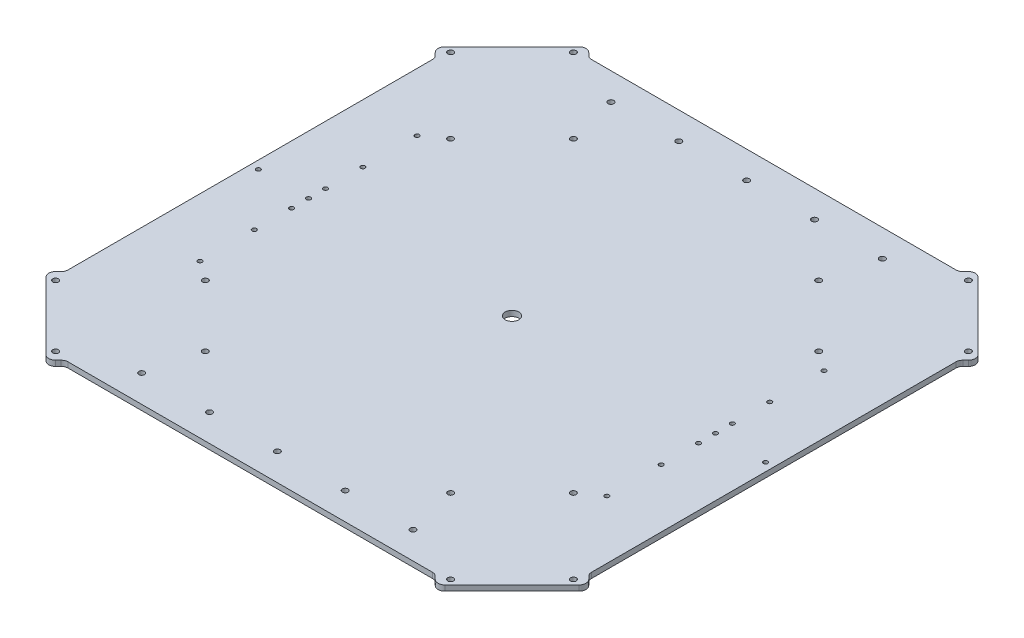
ISO-10303-21;
HEADER;
FILE_DESCRIPTION(('STEP AP214'),'2;1');
FILE_NAME('part.step','',(''),(''),'','','');
FILE_SCHEMA(('AUTOMOTIVE_DESIGN { 1 0 10303 214 1 1 1 1 }'));
ENDSEC;
DATA;
#1=APPLICATION_CONTEXT('core data for automotive mechanical design processes');
#2=APPLICATION_PROTOCOL_DEFINITION('international standard','automotive_design',2000,#1);
#3=PRODUCT_CONTEXT('',#1,'mechanical');
#4=PRODUCT('Part','Part','',(#3));
#5=PRODUCT_RELATED_PRODUCT_CATEGORY('part','',(#4));
#6=PRODUCT_DEFINITION_FORMATION('','',#4);
#7=PRODUCT_DEFINITION_CONTEXT('part definition',#1,'design');
#8=PRODUCT_DEFINITION('design','',#6,#7);
#9=PRODUCT_DEFINITION_SHAPE('','',#8);
#10=(LENGTH_UNIT() NAMED_UNIT(*) SI_UNIT(.MILLI.,.METRE.));
#11=(NAMED_UNIT(*) PLANE_ANGLE_UNIT() SI_UNIT($,.RADIAN.));
#12=(NAMED_UNIT(*) SI_UNIT($,.STERADIAN.) SOLID_ANGLE_UNIT());
#13=UNCERTAINTY_MEASURE_WITH_UNIT(LENGTH_MEASURE(1.E-05),#10,'distance_accuracy_value','');
#14=(GEOMETRIC_REPRESENTATION_CONTEXT(3) GLOBAL_UNCERTAINTY_ASSIGNED_CONTEXT((#13)) GLOBAL_UNIT_ASSIGNED_CONTEXT((#10,
#11,#12)) REPRESENTATION_CONTEXT('',''));
#15=CARTESIAN_POINT('',(0.,0.,0.));
#16=DIRECTION('',(0.,0.,1.));
#17=DIRECTION('',(1.,0.,0.));
#18=AXIS2_PLACEMENT_3D('',#15,#16,#17);
#19=CARTESIAN_POINT('',(-171.715728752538,4.,171.715728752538));
#20=DIRECTION('',(0.707106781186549,0.,-0.707106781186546));
#21=DIRECTION('',(-0.707106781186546,0.,-0.707106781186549));
#22=AXIS2_PLACEMENT_3D('',#19,#20,#21);
#23=PLANE('',#22);
#24=DIRECTION('',(0.707106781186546,0.,0.707106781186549));
#25=VECTOR('',#24,1.);
#26=CARTESIAN_POINT('',(-171.715728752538,4.,171.715728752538));
#27=LINE('',#26,#25);
#28=CARTESIAN_POINT('',(-196.464466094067,4.,146.966991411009));
#29=VERTEX_POINT('',#28);
#30=CARTESIAN_POINT('',(-146.966991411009,4.,196.464466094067));
#31=VERTEX_POINT('',#30);
#32=EDGE_CURVE('E495',#29,#31,#27,.T.);
#33=ORIENTED_EDGE('',*,*,#32,.F.);
#34=DIRECTION('',(0.,-1.,0.));
#35=VECTOR('',#34,1.);
#36=CARTESIAN_POINT('',(-196.464466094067,4.,146.966991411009));
#37=LINE('',#36,#35);
#38=CARTESIAN_POINT('',(-196.464466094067,0.,146.966991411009));
#39=VERTEX_POINT('',#38);
#40=EDGE_CURVE('E561',#29,#39,#37,.T.);
#41=ORIENTED_EDGE('',*,*,#40,.T.);
#42=DIRECTION('',(0.707106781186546,0.,0.707106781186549));
#43=VECTOR('',#42,1.);
#44=CARTESIAN_POINT('',(-171.715728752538,0.,171.715728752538));
#45=LINE('',#44,#43);
#46=CARTESIAN_POINT('',(-146.966991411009,0.,196.464466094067));
#47=VERTEX_POINT('',#46);
#48=EDGE_CURVE('E491',#39,#47,#45,.T.);
#49=ORIENTED_EDGE('',*,*,#48,.T.);
#50=DIRECTION('',(0.,-1.,0.));
#51=VECTOR('',#50,1.);
#52=CARTESIAN_POINT('',(-146.966991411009,4.,196.464466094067));
#53=LINE('',#52,#51);
#54=EDGE_CURVE('E558',#47,#31,#53,.F.);
#55=ORIENTED_EDGE('',*,*,#54,.T.);
#56=EDGE_LOOP('',(#33,#41,#49,#55));
#57=FACE_BOUND('',#56,.T.);
#58=ADVANCED_FACE('F41',(#57),#23,.F.);
#59=CARTESIAN_POINT('',(171.715728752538,4.,171.715728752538));
#60=DIRECTION('',(-0.707106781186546,0.,-0.707106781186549));
#61=DIRECTION('',(-0.707106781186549,0.,0.707106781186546));
#62=AXIS2_PLACEMENT_3D('',#59,#60,#61);
#63=PLANE('',#62);
#64=DIRECTION('',(0.707106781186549,0.,-0.707106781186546));
#65=VECTOR('',#64,1.);
#66=CARTESIAN_POINT('',(171.715728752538,4.,171.715728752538));
#67=LINE('',#66,#65);
#68=CARTESIAN_POINT('',(146.96699141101,4.,196.464466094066));
#69=VERTEX_POINT('',#68);
#70=CARTESIAN_POINT('',(196.464466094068,4.,146.966991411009));
#71=VERTEX_POINT('',#70);
#72=EDGE_CURVE('E499',#69,#71,#67,.T.);
#73=ORIENTED_EDGE('',*,*,#72,.F.);
#74=DIRECTION('',(0.,-1.,0.));
#75=VECTOR('',#74,1.);
#76=CARTESIAN_POINT('',(146.96699141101,4.,196.464466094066));
#77=LINE('',#76,#75);
#78=CARTESIAN_POINT('',(146.96699141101,0.,196.464466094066));
#79=VERTEX_POINT('',#78);
#80=EDGE_CURVE('E636',#69,#79,#77,.T.);
#81=ORIENTED_EDGE('',*,*,#80,.T.);
#82=DIRECTION('',(0.707106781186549,0.,-0.707106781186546));
#83=VECTOR('',#82,1.);
#84=CARTESIAN_POINT('',(171.715728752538,0.,171.715728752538));
#85=LINE('',#84,#83);
#86=CARTESIAN_POINT('',(196.464466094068,0.,146.966991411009));
#87=VERTEX_POINT('',#86);
#88=EDGE_CURVE('E514',#79,#87,#85,.T.);
#89=ORIENTED_EDGE('',*,*,#88,.T.);
#90=DIRECTION('',(0.,-1.,0.));
#91=VECTOR('',#90,1.);
#92=CARTESIAN_POINT('',(196.464466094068,4.,146.966991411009));
#93=LINE('',#92,#91);
#94=EDGE_CURVE('E633',#87,#71,#93,.F.);
#95=ORIENTED_EDGE('',*,*,#94,.T.);
#96=EDGE_LOOP('',(#73,#81,#89,#95));
#97=FACE_BOUND('',#96,.T.);
#98=ADVANCED_FACE('F1016',(#97),#63,.F.);
#99=CARTESIAN_POINT('',(171.715728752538,4.,-171.715728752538));
#100=DIRECTION('',(-0.707106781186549,0.,0.707106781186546));
#101=DIRECTION('',(0.707106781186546,0.,0.707106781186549));
#102=AXIS2_PLACEMENT_3D('',#99,#100,#101);
#103=PLANE('',#102);
#104=DIRECTION('',(-0.707106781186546,0.,-0.707106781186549));
#105=VECTOR('',#104,1.);
#106=CARTESIAN_POINT('',(171.715728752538,4.,-171.715728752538));
#107=LINE('',#106,#105);
#108=CARTESIAN_POINT('',(196.464466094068,4.,-146.966991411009));
#109=VERTEX_POINT('',#108);
#110=CARTESIAN_POINT('',(146.966991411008,4.,-196.464466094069));
#111=VERTEX_POINT('',#110);
#112=EDGE_CURVE('E504',#109,#111,#107,.T.);
#113=ORIENTED_EDGE('',*,*,#112,.F.);
#114=DIRECTION('',(0.,-1.,0.));
#115=VECTOR('',#114,1.);
#116=CARTESIAN_POINT('',(196.464466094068,4.,-146.966991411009));
#117=LINE('',#116,#115);
#118=CARTESIAN_POINT('',(196.464466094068,0.,-146.966991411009));
#119=VERTEX_POINT('',#118);
#120=EDGE_CURVE('E664',#109,#119,#117,.T.);
#121=ORIENTED_EDGE('',*,*,#120,.T.);
#122=DIRECTION('',(-0.707106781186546,0.,-0.707106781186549));
#123=VECTOR('',#122,1.);
#124=CARTESIAN_POINT('',(171.715728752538,0.,-171.715728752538));
#125=LINE('',#124,#123);
#126=CARTESIAN_POINT('',(146.966991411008,0.,-196.464466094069));
#127=VERTEX_POINT('',#126);
#128=EDGE_CURVE('E518',#119,#127,#125,.T.);
#129=ORIENTED_EDGE('',*,*,#128,.T.);
#130=DIRECTION('',(0.,-1.,0.));
#131=VECTOR('',#130,1.);
#132=CARTESIAN_POINT('',(146.966991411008,4.,-196.464466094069));
#133=LINE('',#132,#131);
#134=EDGE_CURVE('E661',#127,#111,#133,.F.);
#135=ORIENTED_EDGE('',*,*,#134,.T.);
#136=EDGE_LOOP('',(#113,#121,#129,#135));
#137=FACE_BOUND('',#136,.T.);
#138=ADVANCED_FACE('F1022',(#137),#103,.F.);
#139=CARTESIAN_POINT('',(-171.715728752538,4.,-171.715728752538));
#140=DIRECTION('',(0.707106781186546,0.,0.707106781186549));
#141=DIRECTION('',(0.707106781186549,0.,-0.707106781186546));
#142=AXIS2_PLACEMENT_3D('',#139,#140,#141);
#143=PLANE('',#142);
#144=DIRECTION('',(-0.707106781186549,0.,0.707106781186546));
#145=VECTOR('',#144,1.);
#146=CARTESIAN_POINT('',(-171.715728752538,4.,-171.715728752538));
#147=LINE('',#146,#145);
#148=CARTESIAN_POINT('',(-146.966991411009,4.,-196.464466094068));
#149=VERTEX_POINT('',#148);
#150=CARTESIAN_POINT('',(-196.464466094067,4.,-146.966991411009));
#151=VERTEX_POINT('',#150);
#152=EDGE_CURVE('E508',#149,#151,#147,.T.);
#153=ORIENTED_EDGE('',*,*,#152,.F.);
#154=DIRECTION('',(0.,-1.,0.));
#155=VECTOR('',#154,1.);
#156=CARTESIAN_POINT('',(-146.966991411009,4.,-196.464466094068));
#157=LINE('',#156,#155);
#158=CARTESIAN_POINT('',(-146.966991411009,0.,-196.464466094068));
#159=VERTEX_POINT('',#158);
#160=EDGE_CURVE('E691',#149,#159,#157,.T.);
#161=ORIENTED_EDGE('',*,*,#160,.T.);
#162=DIRECTION('',(-0.707106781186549,0.,0.707106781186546));
#163=VECTOR('',#162,1.);
#164=CARTESIAN_POINT('',(-171.715728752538,0.,-171.715728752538));
#165=LINE('',#164,#163);
#166=CARTESIAN_POINT('',(-196.464466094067,0.,-146.966991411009));
#167=VERTEX_POINT('',#166);
#168=EDGE_CURVE('E500',#159,#167,#165,.T.);
#169=ORIENTED_EDGE('',*,*,#168,.T.);
#170=DIRECTION('',(0.,-1.,0.));
#171=VECTOR('',#170,1.);
#172=CARTESIAN_POINT('',(-196.464466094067,4.,-146.966991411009));
#173=LINE('',#172,#171);
#174=EDGE_CURVE('E57',#167,#151,#173,.F.);
#175=ORIENTED_EDGE('',*,*,#174,.T.);
#176=EDGE_LOOP('',(#153,#161,#169,#175));
#177=FACE_BOUND('',#176,.T.);
#178=ADVANCED_FACE('F944',(#177),#143,.F.);
#179=CARTESIAN_POINT('',(0.,4.,0.));
#180=DIRECTION('',(0.,1.,0.));
#181=DIRECTION('',(0.,0.,1.));
#182=AXIS2_PLACEMENT_3D('',#179,#180,#181);
#183=PLANE('',#182);
#184=CARTESIAN_POINT('',(-186.928932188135,4.,0.));
#185=DIRECTION('',(0.,1.,0.));
#186=DIRECTION('',(0.,0.,1.));
#187=AXIS2_PLACEMENT_3D('',#184,#185,#186);
#188=CIRCLE('',#187,1.59999999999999);
#189=CARTESIAN_POINT('',(-186.928932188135,4.,1.59999999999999));
#190=VERTEX_POINT('',#189);
#191=EDGE_CURVE('E547',#190,#190,#188,.T.);
#192=ORIENTED_EDGE('',*,*,#191,.F.);
#193=EDGE_LOOP('',(#192));
#194=FACE_BOUND('',#193,.T.);
#195=CARTESIAN_POINT('',(186.928932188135,4.,0.));
#196=DIRECTION('',(0.,1.,0.));
#197=DIRECTION('',(0.,0.,-1.));
#198=AXIS2_PLACEMENT_3D('',#195,#196,#197);
#199=CIRCLE('',#198,1.59999999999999);
#200=CARTESIAN_POINT('',(186.928932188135,4.,-1.59999999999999));
#201=VERTEX_POINT('',#200);
#202=EDGE_CURVE('E930',#201,#201,#199,.T.);
#203=ORIENTED_EDGE('',*,*,#202,.F.);
#204=EDGE_LOOP('',(#203));
#205=FACE_BOUND('',#204,.T.);
#206=CARTESIAN_POINT('',(-149.928932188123,4.,12.4999999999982));
#207=DIRECTION('',(0.,1.,0.));
#208=DIRECTION('',(0.,0.,1.));
#209=AXIS2_PLACEMENT_3D('',#206,#207,#208);
#210=CIRCLE('',#209,1.59999999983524);
#211=CARTESIAN_POINT('',(-149.928932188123,4.,14.0999999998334));
#212=VERTEX_POINT('',#211);
#213=EDGE_CURVE('E919',#212,#212,#210,.T.);
#214=ORIENTED_EDGE('',*,*,#213,.F.);
#215=EDGE_LOOP('',(#214));
#216=FACE_BOUND('',#215,.T.);
#217=CARTESIAN_POINT('',(149.928932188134,4.,-12.4999999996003));
#218=DIRECTION('',(0.,1.,0.));
#219=DIRECTION('',(0.,0.,1.));
#220=AXIS2_PLACEMENT_3D('',#217,#218,#219);
#221=CIRCLE('',#220,1.59999999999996);
#222=CARTESIAN_POINT('',(149.928932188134,4.,-10.8999999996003));
#223=VERTEX_POINT('',#222);
#224=EDGE_CURVE('E920',#223,#223,#221,.T.);
#225=ORIENTED_EDGE('',*,*,#224,.F.);
#226=EDGE_LOOP('',(#225));
#227=FACE_BOUND('',#226,.T.);
#228=CARTESIAN_POINT('',(149.928932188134,4.,12.5000000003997));
#229=DIRECTION('',(0.,1.,0.));
#230=DIRECTION('',(0.,0.,1.));
#231=AXIS2_PLACEMENT_3D('',#228,#229,#230);
#232=CIRCLE('',#231,1.59999999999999);
#233=CARTESIAN_POINT('',(149.928932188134,4.,14.1000000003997));
#234=VERTEX_POINT('',#233);
#235=EDGE_CURVE('E551',#234,#234,#232,.T.);
#236=ORIENTED_EDGE('',*,*,#235,.F.);
#237=EDGE_LOOP('',(#236));
#238=FACE_BOUND('',#237,.T.);
#239=CARTESIAN_POINT('',(-149.928932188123,4.,-12.5000000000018));
#240=DIRECTION('',(0.,1.,0.));
#241=DIRECTION('',(0.,0.,1.));
#242=AXIS2_PLACEMENT_3D('',#239,#240,#241);
#243=CIRCLE('',#242,1.59999999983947);
#244=CARTESIAN_POINT('',(-149.928932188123,4.,-10.9000000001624));
#245=VERTEX_POINT('',#244);
#246=EDGE_CURVE('E529',#245,#245,#243,.T.);
#247=ORIENTED_EDGE('',*,*,#246,.F.);
#248=EDGE_LOOP('',(#247));
#249=FACE_BOUND('',#248,.T.);
#250=CARTESIAN_POINT('',(50.,4.,-172.928932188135));
#251=DIRECTION('',(0.,1.,0.));
#252=DIRECTION('',(0.,0.,1.));
#253=AXIS2_PLACEMENT_3D('',#250,#251,#252);
#254=CIRCLE('',#253,2.09999999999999);
#255=CARTESIAN_POINT('',(50.,4.,-170.828932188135));
#256=VERTEX_POINT('',#255);
#257=EDGE_CURVE('E903',#256,#256,#254,.T.);
#258=ORIENTED_EDGE('',*,*,#257,.F.);
#259=EDGE_LOOP('',(#258));
#260=FACE_BOUND('',#259,.T.);
#261=CARTESIAN_POINT('',(100.,4.,-172.928932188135));
#262=DIRECTION('',(0.,1.,0.));
#263=DIRECTION('',(0.,0.,1.));
#264=AXIS2_PLACEMENT_3D('',#261,#262,#263);
#265=CIRCLE('',#264,2.1);
#266=CARTESIAN_POINT('',(100.,4.,-170.828932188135));
#267=VERTEX_POINT('',#266);
#268=EDGE_CURVE('E895',#267,#267,#265,.T.);
#269=ORIENTED_EDGE('',*,*,#268,.F.);
#270=EDGE_LOOP('',(#269));
#271=FACE_BOUND('',#270,.T.);
#272=CARTESIAN_POINT('',(-100.000000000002,4.,-172.928932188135));
#273=DIRECTION('',(0.,1.,0.));
#274=DIRECTION('',(0.,0.,-1.));
#275=AXIS2_PLACEMENT_3D('',#272,#273,#274);
#276=CIRCLE('',#275,2.1);
#277=CARTESIAN_POINT('',(-100.000000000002,4.,-175.028932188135));
#278=VERTEX_POINT('',#277);
#279=EDGE_CURVE('E887',#278,#278,#276,.T.);
#280=ORIENTED_EDGE('',*,*,#279,.F.);
#281=EDGE_LOOP('',(#280));
#282=FACE_BOUND('',#281,.T.);
#283=CARTESIAN_POINT('',(-50.0000000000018,4.,-172.928932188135));
#284=DIRECTION('',(0.,1.,0.));
#285=DIRECTION('',(0.,0.,-1.));
#286=AXIS2_PLACEMENT_3D('',#283,#284,#285);
#287=CIRCLE('',#286,2.09999999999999);
#288=CARTESIAN_POINT('',(-50.0000000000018,4.,-175.028932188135));
#289=VERTEX_POINT('',#288);
#290=EDGE_CURVE('E879',#289,#289,#287,.T.);
#291=ORIENTED_EDGE('',*,*,#290,.F.);
#292=EDGE_LOOP('',(#291));
#293=FACE_BOUND('',#292,.T.);
#294=CARTESIAN_POINT('',(-50.,4.,172.928932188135));
#295=DIRECTION('',(0.,1.,0.));
#296=DIRECTION('',(0.,0.,1.));
#297=AXIS2_PLACEMENT_3D('',#294,#295,#296);
#298=CIRCLE('',#297,2.09999999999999);
#299=CARTESIAN_POINT('',(-50.,4.,175.028932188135));
#300=VERTEX_POINT('',#299);
#301=EDGE_CURVE('E871',#300,#300,#298,.T.);
#302=ORIENTED_EDGE('',*,*,#301,.F.);
#303=EDGE_LOOP('',(#302));
#304=FACE_BOUND('',#303,.T.);
#305=CARTESIAN_POINT('',(-100.,4.,172.928932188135));
#306=DIRECTION('',(0.,1.,0.));
#307=DIRECTION('',(0.,0.,1.));
#308=AXIS2_PLACEMENT_3D('',#305,#306,#307);
#309=CIRCLE('',#308,2.1);
#310=CARTESIAN_POINT('',(-100.,4.,175.028932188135));
#311=VERTEX_POINT('',#310);
#312=EDGE_CURVE('E863',#311,#311,#309,.T.);
#313=ORIENTED_EDGE('',*,*,#312,.F.);
#314=EDGE_LOOP('',(#313));
#315=FACE_BOUND('',#314,.T.);
#316=CARTESIAN_POINT('',(100.,4.,172.928932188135));
#317=DIRECTION('',(0.,1.,0.));
#318=DIRECTION('',(0.,0.,-1.));
#319=AXIS2_PLACEMENT_3D('',#316,#317,#318);
#320=CIRCLE('',#319,2.1);
#321=CARTESIAN_POINT('',(100.,4.,170.828932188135));
#322=VERTEX_POINT('',#321);
#323=EDGE_CURVE('E855',#322,#322,#320,.T.);
#324=ORIENTED_EDGE('',*,*,#323,.F.);
#325=EDGE_LOOP('',(#324));
#326=FACE_BOUND('',#325,.T.);
#327=CARTESIAN_POINT('',(50.,4.,172.928932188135));
#328=DIRECTION('',(0.,1.,0.));
#329=DIRECTION('',(0.,0.,-1.));
#330=AXIS2_PLACEMENT_3D('',#327,#328,#329);
#331=CIRCLE('',#330,2.09999999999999);
#332=CARTESIAN_POINT('',(50.,4.,170.828932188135));
#333=VERTEX_POINT('',#332);
#334=EDGE_CURVE('E846',#333,#333,#331,.T.);
#335=ORIENTED_EDGE('',*,*,#334,.F.);
#336=EDGE_LOOP('',(#335));
#337=FACE_BOUND('',#336,.T.);
#338=CARTESIAN_POINT('',(0.,4.,172.928932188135));
#339=DIRECTION('',(0.,1.,0.));
#340=DIRECTION('',(0.,0.,-1.));
#341=AXIS2_PLACEMENT_3D('',#338,#339,#340);
#342=CIRCLE('',#341,2.1);
#343=CARTESIAN_POINT('',(0.,4.,170.828932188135));
#344=VERTEX_POINT('',#343);
#345=EDGE_CURVE('E541',#344,#344,#342,.T.);
#346=ORIENTED_EDGE('',*,*,#345,.F.);
#347=EDGE_LOOP('',(#346));
#348=FACE_BOUND('',#347,.T.);
#349=CARTESIAN_POINT('',(0.,4.,-172.928932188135));
#350=DIRECTION('',(0.,1.,0.));
#351=DIRECTION('',(0.,0.,1.));
#352=AXIS2_PLACEMENT_3D('',#349,#350,#351);
#353=CIRCLE('',#352,2.1);
#354=CARTESIAN_POINT('',(0.,4.,-170.828932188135));
#355=VERTEX_POINT('',#354);
#356=EDGE_CURVE('E838',#355,#355,#353,.T.);
#357=ORIENTED_EDGE('',*,*,#356,.F.);
#358=EDGE_LOOP('',(#357));
#359=FACE_BOUND('',#358,.T.);
#360=CARTESIAN_POINT('',(149.928932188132,4.,80.0000000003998));
#361=DIRECTION('',(0.,-1.,0.));
#362=DIRECTION('',(0.,0.,1.));
#363=AXIS2_PLACEMENT_3D('',#360,#361,#362);
#364=CIRCLE('',#363,1.59999999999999);
#365=CARTESIAN_POINT('',(149.928932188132,4.,81.6000000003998));
#366=VERTEX_POINT('',#365);
#367=EDGE_CURVE('E770',#366,#366,#364,.T.);
#368=ORIENTED_EDGE('',*,*,#367,.T.);
#369=EDGE_LOOP('',(#368));
#370=FACE_BOUND('',#369,.T.);
#371=CARTESIAN_POINT('',(149.928932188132,4.,40.0000000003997));
#372=DIRECTION('',(0.,-1.,0.));
#373=DIRECTION('',(0.,0.,1.));
#374=AXIS2_PLACEMENT_3D('',#371,#372,#373);
#375=CIRCLE('',#374,1.59999999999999);
#376=CARTESIAN_POINT('',(149.928932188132,4.,41.6000000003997));
#377=VERTEX_POINT('',#376);
#378=EDGE_CURVE('E779',#377,#377,#375,.T.);
#379=ORIENTED_EDGE('',*,*,#378,.T.);
#380=EDGE_LOOP('',(#379));
#381=FACE_BOUND('',#380,.T.);
#382=CARTESIAN_POINT('',(149.928932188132,4.,3.99735800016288E-10));
#383=DIRECTION('',(0.,-1.,0.));
#384=DIRECTION('',(0.,0.,1.));
#385=AXIS2_PLACEMENT_3D('',#382,#383,#384);
#386=CIRCLE('',#385,1.59999999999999);
#387=CARTESIAN_POINT('',(149.928932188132,4.,1.60000000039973));
#388=VERTEX_POINT('',#387);
#389=EDGE_CURVE('E787',#388,#388,#386,.T.);
#390=ORIENTED_EDGE('',*,*,#389,.T.);
#391=EDGE_LOOP('',(#390));
#392=FACE_BOUND('',#391,.T.);
#393=CARTESIAN_POINT('',(149.928932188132,4.,-39.9999999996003));
#394=DIRECTION('',(0.,-1.,0.));
#395=DIRECTION('',(0.,0.,1.));
#396=AXIS2_PLACEMENT_3D('',#393,#394,#395);
#397=CIRCLE('',#396,1.59999999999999);
#398=CARTESIAN_POINT('',(149.928932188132,4.,-38.3999999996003));
#399=VERTEX_POINT('',#398);
#400=EDGE_CURVE('E795',#399,#399,#397,.T.);
#401=ORIENTED_EDGE('',*,*,#400,.T.);
#402=EDGE_LOOP('',(#401));
#403=FACE_BOUND('',#402,.T.);
#404=CARTESIAN_POINT('',(149.928932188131,4.,-79.9999999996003));
#405=DIRECTION('',(0.,-1.,0.));
#406=DIRECTION('',(0.,0.,1.));
#407=AXIS2_PLACEMENT_3D('',#404,#405,#406);
#408=CIRCLE('',#407,1.59999999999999);
#409=CARTESIAN_POINT('',(149.928932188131,4.,-78.3999999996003));
#410=VERTEX_POINT('',#409);
#411=EDGE_CURVE('E803',#410,#410,#408,.T.);
#412=ORIENTED_EDGE('',*,*,#411,.T.);
#413=EDGE_LOOP('',(#412));
#414=FACE_BOUND('',#413,.T.);
#415=CARTESIAN_POINT('',(-149.928932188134,4.,-79.999999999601));
#416=DIRECTION('',(0.,-1.,0.));
#417=DIRECTION('',(0.,0.,-1.));
#418=AXIS2_PLACEMENT_3D('',#415,#416,#417);
#419=CIRCLE('',#418,1.59999999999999);
#420=CARTESIAN_POINT('',(-149.928932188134,4.,-81.599999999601));
#421=VERTEX_POINT('',#420);
#422=EDGE_CURVE('E811',#421,#421,#419,.T.);
#423=ORIENTED_EDGE('',*,*,#422,.T.);
#424=EDGE_LOOP('',(#423));
#425=FACE_BOUND('',#424,.T.);
#426=CARTESIAN_POINT('',(-149.928932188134,4.,-39.999999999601));
#427=DIRECTION('',(0.,-1.,0.));
#428=DIRECTION('',(0.,0.,-1.));
#429=AXIS2_PLACEMENT_3D('',#426,#427,#428);
#430=CIRCLE('',#429,1.59999999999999);
#431=CARTESIAN_POINT('',(-149.928932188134,4.,-41.599999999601));
#432=VERTEX_POINT('',#431);
#433=EDGE_CURVE('E819',#432,#432,#430,.T.);
#434=ORIENTED_EDGE('',*,*,#433,.T.);
#435=EDGE_LOOP('',(#434));
#436=FACE_BOUND('',#435,.T.);
#437=CARTESIAN_POINT('',(-149.928932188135,4.,3.9895864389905E-10));
#438=DIRECTION('',(0.,-1.,0.));
#439=DIRECTION('',(0.,0.,-1.));
#440=AXIS2_PLACEMENT_3D('',#437,#438,#439);
#441=CIRCLE('',#440,1.59999999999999);
#442=CARTESIAN_POINT('',(-149.928932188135,4.,-1.59999999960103));
#443=VERTEX_POINT('',#442);
#444=EDGE_CURVE('E827',#443,#443,#441,.T.);
#445=ORIENTED_EDGE('',*,*,#444,.T.);
#446=EDGE_LOOP('',(#445));
#447=FACE_BOUND('',#446,.T.);
#448=CARTESIAN_POINT('',(-149.928932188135,4.,40.000000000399));
#449=DIRECTION('',(0.,-1.,0.));
#450=DIRECTION('',(0.,0.,-1.));
#451=AXIS2_PLACEMENT_3D('',#448,#449,#450);
#452=CIRCLE('',#451,1.59999999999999);
#453=CARTESIAN_POINT('',(-149.928932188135,4.,38.400000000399));
#454=VERTEX_POINT('',#453);
#455=EDGE_CURVE('E762',#454,#454,#452,.T.);
#456=ORIENTED_EDGE('',*,*,#455,.T.);
#457=EDGE_LOOP('',(#456));
#458=FACE_BOUND('',#457,.T.);
#459=CARTESIAN_POINT('',(-149.928932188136,4.,80.000000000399));
#460=DIRECTION('',(0.,-1.,0.));
#461=DIRECTION('',(0.,0.,-1.));
#462=AXIS2_PLACEMENT_3D('',#459,#460,#461);
#463=CIRCLE('',#462,1.59999999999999);
#464=CARTESIAN_POINT('',(-149.928932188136,4.,78.400000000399));
#465=VERTEX_POINT('',#464);
#466=EDGE_CURVE('E754',#465,#465,#463,.T.);
#467=ORIENTED_EDGE('',*,*,#466,.T.);
#468=EDGE_LOOP('',(#467));
#469=FACE_BOUND('',#468,.T.);
#470=CARTESIAN_POINT('',(0.,4.,0.));
#471=DIRECTION('',(0.,1.,0.));
#472=DIRECTION('',(0.,0.,1.));
#473=AXIS2_PLACEMENT_3D('',#470,#471,#472);
#474=CIRCLE('',#473,5.);
#475=CARTESIAN_POINT('',(0.,4.,5.));
#476=VERTEX_POINT('',#475);
#477=EDGE_CURVE('E750',#476,#476,#474,.T.);
#478=ORIENTED_EDGE('',*,*,#477,.F.);
#479=EDGE_LOOP('',(#478));
#480=FACE_BOUND('',#479,.T.);
#481=DIRECTION('',(0.707106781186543,0.,-0.707106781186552));
#482=VECTOR('',#481,1.);
#483=CARTESIAN_POINT('',(-200.,4.,143.431457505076));
#484=LINE('',#483,#482);
#485=CARTESIAN_POINT('',(-196.464466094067,4.,139.895923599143));
#486=VERTEX_POINT('',#485);
#487=CARTESIAN_POINT('',(-194.393398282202,4.,137.824855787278));
#488=VERTEX_POINT('',#487);
#489=EDGE_CURVE('E282',#486,#488,#484,.T.);
#490=ORIENTED_EDGE('',*,*,#489,.F.);
#491=CARTESIAN_POINT('',(-192.928932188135,4.,143.431457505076));
#492=DIRECTION('',(0.,1.,0.));
#493=DIRECTION('',(0.,0.,1.));
#494=AXIS2_PLACEMENT_3D('',#491,#492,#493);
#495=CIRCLE('',#494,5.);
#496=EDGE_CURVE('E609',#486,#29,#495,.T.);
#497=ORIENTED_EDGE('',*,*,#496,.T.);
#498=ORIENTED_EDGE('',*,*,#32,.T.);
#499=CARTESIAN_POINT('',(-143.431457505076,4.,192.928932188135));
#500=DIRECTION('',(0.,1.,0.));
#501=DIRECTION('',(0.,0.,1.));
#502=AXIS2_PLACEMENT_3D('',#499,#500,#501);
#503=CIRCLE('',#502,5.);
#504=CARTESIAN_POINT('',(-139.895923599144,4.,196.464466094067));
#505=VERTEX_POINT('',#504);
#506=EDGE_CURVE('E606',#31,#505,#503,.T.);
#507=ORIENTED_EDGE('',*,*,#506,.T.);
#508=DIRECTION('',(-0.707106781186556,0.,0.707106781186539));
#509=VECTOR('',#508,1.);
#510=CARTESIAN_POINT('',(-143.431457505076,4.,200.));
#511=LINE('',#510,#509);
#512=CARTESIAN_POINT('',(-137.824855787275,4.,194.393398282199));
#513=VERTEX_POINT('',#512);
#514=EDGE_CURVE('E346',#513,#505,#511,.T.);
#515=ORIENTED_EDGE('',*,*,#514,.F.);
#516=CARTESIAN_POINT('',(-134.289321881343,4.,197.928932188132));
#517=DIRECTION('',(0.,1.,0.));
#518=DIRECTION('',(0.,0.,1.));
#519=AXIS2_PLACEMENT_3D('',#516,#517,#518);
#520=CIRCLE('',#519,5.);
#521=CARTESIAN_POINT('',(-134.289321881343,4.,192.928932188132));
#522=VERTEX_POINT('',#521);
#523=EDGE_CURVE('E704',#513,#522,#520,.F.);
#524=ORIENTED_EDGE('',*,*,#523,.T.);
#525=DIRECTION('',(-1.,0.,0.));
#526=VECTOR('',#525,1.);
#527=CARTESIAN_POINT('',(-136.360389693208,4.,192.928932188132));
#528=LINE('',#527,#526);
#529=CARTESIAN_POINT('',(134.289321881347,4.,192.928932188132));
#530=VERTEX_POINT('',#529);
#531=EDGE_CURVE('E357',#530,#522,#528,.T.);
#532=ORIENTED_EDGE('',*,*,#531,.F.);
#533=CARTESIAN_POINT('',(134.289321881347,4.,197.928932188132));
#534=DIRECTION('',(0.,1.,0.));
#535=DIRECTION('',(0.,0.,1.));
#536=AXIS2_PLACEMENT_3D('',#533,#534,#535);
#537=CIRCLE('',#536,5.);
#538=CARTESIAN_POINT('',(137.824855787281,4.,194.3933982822));
#539=VERTEX_POINT('',#538);
#540=EDGE_CURVE('E710',#530,#539,#537,.F.);
#541=ORIENTED_EDGE('',*,*,#540,.T.);
#542=DIRECTION('',(-0.707106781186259,0.,-0.707106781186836));
#543=VECTOR('',#542,1.);
#544=CARTESIAN_POINT('',(143.431457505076,4.,200.));
#545=LINE('',#544,#543);
#546=CARTESIAN_POINT('',(139.895923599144,4.,196.464466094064));
#547=VERTEX_POINT('',#546);
#548=EDGE_CURVE('E353',#547,#539,#545,.T.);
#549=ORIENTED_EDGE('',*,*,#548,.F.);
#550=CARTESIAN_POINT('',(143.431457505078,4.,192.928932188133));
#551=DIRECTION('',(0.,1.,0.));
#552=DIRECTION('',(0.,0.,1.));
#553=AXIS2_PLACEMENT_3D('',#550,#551,#552);
#554=CIRCLE('',#553,5.);
#555=EDGE_CURVE('E603',#547,#69,#554,.T.);
#556=ORIENTED_EDGE('',*,*,#555,.T.);
#557=ORIENTED_EDGE('',*,*,#72,.T.);
#558=CARTESIAN_POINT('',(192.928932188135,4.,143.431457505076));
#559=DIRECTION('',(0.,1.,0.));
#560=DIRECTION('',(0.,0.,1.));
#561=AXIS2_PLACEMENT_3D('',#558,#559,#560);
#562=CIRCLE('',#561,5.);
#563=CARTESIAN_POINT('',(196.464466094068,4.,139.895923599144));
#564=VERTEX_POINT('',#563);
#565=EDGE_CURVE('E600',#71,#564,#562,.T.);
#566=ORIENTED_EDGE('',*,*,#565,.T.);
#567=DIRECTION('',(0.707106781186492,0.,0.707106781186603));
#568=VECTOR('',#567,1.);
#569=CARTESIAN_POINT('',(200.,4.,143.431457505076));
#570=LINE('',#569,#568);
#571=CARTESIAN_POINT('',(194.393398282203,4.,137.824855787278));
#572=VERTEX_POINT('',#571);
#573=EDGE_CURVE('E322',#572,#564,#570,.T.);
#574=ORIENTED_EDGE('',*,*,#573,.F.);
#575=CARTESIAN_POINT('',(197.928932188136,4.,134.289321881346));
#576=DIRECTION('',(0.,1.,0.));
#577=DIRECTION('',(0.,0.,1.));
#578=AXIS2_PLACEMENT_3D('',#575,#576,#577);
#579=CIRCLE('',#578,5.);
#580=CARTESIAN_POINT('',(192.928932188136,4.,134.289321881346));
#581=VERTEX_POINT('',#580);
#582=EDGE_CURVE('E716',#572,#581,#579,.F.);
#583=ORIENTED_EDGE('',*,*,#582,.T.);
#584=DIRECTION('',(0.,0.,1.));
#585=VECTOR('',#584,1.);
#586=CARTESIAN_POINT('',(192.928932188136,4.,136.360389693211));
#587=LINE('',#586,#585);
#588=CARTESIAN_POINT('',(192.928932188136,4.,-134.289321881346));
#589=VERTEX_POINT('',#588);
#590=EDGE_CURVE('E333',#589,#581,#587,.T.);
#591=ORIENTED_EDGE('',*,*,#590,.F.);
#592=CARTESIAN_POINT('',(197.928932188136,4.,-134.289321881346));
#593=DIRECTION('',(0.,1.,0.));
#594=DIRECTION('',(0.,0.,1.));
#595=AXIS2_PLACEMENT_3D('',#592,#593,#594);
#596=CIRCLE('',#595,5.);
#597=CARTESIAN_POINT('',(194.393398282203,4.,-137.824855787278));
#598=VERTEX_POINT('',#597);
#599=EDGE_CURVE('E722',#589,#598,#596,.F.);
#600=ORIENTED_EDGE('',*,*,#599,.T.);
#601=DIRECTION('',(-0.707106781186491,0.,0.707106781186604));
#602=VECTOR('',#601,1.);
#603=CARTESIAN_POINT('',(200.,4.,-143.431457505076));
#604=LINE('',#603,#602);
#605=CARTESIAN_POINT('',(196.464466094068,4.,-139.895923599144));
#606=VERTEX_POINT('',#605);
#607=EDGE_CURVE('E329',#606,#598,#604,.T.);
#608=ORIENTED_EDGE('',*,*,#607,.F.);
#609=CARTESIAN_POINT('',(192.928932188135,4.,-143.431457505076));
#610=DIRECTION('',(0.,1.,0.));
#611=DIRECTION('',(0.,0.,1.));
#612=AXIS2_PLACEMENT_3D('',#609,#610,#611);
#613=CIRCLE('',#612,5.);
#614=EDGE_CURVE('E597',#606,#109,#613,.T.);
#615=ORIENTED_EDGE('',*,*,#614,.T.);
#616=ORIENTED_EDGE('',*,*,#112,.T.);
#617=CARTESIAN_POINT('',(143.431457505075,4.,-192.928932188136));
#618=DIRECTION('',(0.,1.,0.));
#619=DIRECTION('',(0.,0.,1.));
#620=AXIS2_PLACEMENT_3D('',#617,#618,#619);
#621=CIRCLE('',#620,5.);
#622=CARTESIAN_POINT('',(139.895923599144,4.,-196.46446609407));
#623=VERTEX_POINT('',#622);
#624=EDGE_CURVE('E594',#111,#623,#621,.T.);
#625=ORIENTED_EDGE('',*,*,#624,.T.);
#626=DIRECTION('',(0.70710678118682,0.,-0.707106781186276));
#627=VECTOR('',#626,1.);
#628=CARTESIAN_POINT('',(143.431457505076,4.,-200.));
#629=LINE('',#628,#627);
#630=CARTESIAN_POINT('',(137.824855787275,4.,-194.393398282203));
#631=VERTEX_POINT('',#630);
#632=EDGE_CURVE('E298',#631,#623,#629,.T.);
#633=ORIENTED_EDGE('',*,*,#632,.F.);
#634=CARTESIAN_POINT('',(134.289321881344,4.,-197.928932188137));
#635=DIRECTION('',(0.,1.,0.));
#636=DIRECTION('',(0.,0.,1.));
#637=AXIS2_PLACEMENT_3D('',#634,#635,#636);
#638=CIRCLE('',#637,5.);
#639=CARTESIAN_POINT('',(134.289321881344,4.,-192.928932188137));
#640=VERTEX_POINT('',#639);
#641=EDGE_CURVE('E728',#631,#640,#638,.F.);
#642=ORIENTED_EDGE('',*,*,#641,.T.);
#643=DIRECTION('',(1.,0.,0.));
#644=VECTOR('',#643,1.);
#645=CARTESIAN_POINT('',(136.360389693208,4.,-192.928932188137));
#646=LINE('',#645,#644);
#647=CARTESIAN_POINT('',(-134.289321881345,4.,-192.928932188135));
#648=VERTEX_POINT('',#647);
#649=EDGE_CURVE('E309',#648,#640,#646,.T.);
#650=ORIENTED_EDGE('',*,*,#649,.F.);
#651=CARTESIAN_POINT('',(-134.289321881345,4.,-197.928932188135));
#652=DIRECTION('',(0.,1.,0.));
#653=DIRECTION('',(0.,0.,1.));
#654=AXIS2_PLACEMENT_3D('',#651,#652,#653);
#655=CIRCLE('',#654,5.);
#656=CARTESIAN_POINT('',(-137.824855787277,4.,-194.393398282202));
#657=VERTEX_POINT('',#656);
#658=EDGE_CURVE('E734',#648,#657,#655,.F.);
#659=ORIENTED_EDGE('',*,*,#658,.T.);
#660=DIRECTION('',(0.707106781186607,0.,0.707106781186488));
#661=VECTOR('',#660,1.);
#662=CARTESIAN_POINT('',(-143.431457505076,4.,-200.));
#663=LINE('',#662,#661);
#664=CARTESIAN_POINT('',(-139.895923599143,4.,-196.464466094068));
#665=VERTEX_POINT('',#664);
#666=EDGE_CURVE('E305',#665,#657,#663,.T.);
#667=ORIENTED_EDGE('',*,*,#666,.F.);
#668=CARTESIAN_POINT('',(-143.431457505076,4.,-192.928932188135));
#669=DIRECTION('',(0.,1.,0.));
#670=DIRECTION('',(0.,0.,1.));
#671=AXIS2_PLACEMENT_3D('',#668,#669,#670);
#672=CIRCLE('',#671,5.);
#673=EDGE_CURVE('E64',#665,#149,#672,.T.);
#674=ORIENTED_EDGE('',*,*,#673,.T.);
#675=ORIENTED_EDGE('',*,*,#152,.T.);
#676=CARTESIAN_POINT('',(-192.928932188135,4.,-143.431457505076));
#677=DIRECTION('',(0.,1.,0.));
#678=DIRECTION('',(0.,0.,1.));
#679=AXIS2_PLACEMENT_3D('',#676,#677,#678);
#680=CIRCLE('',#679,5.);
#681=CARTESIAN_POINT('',(-196.464466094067,4.,-139.895923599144));
#682=VERTEX_POINT('',#681);
#683=EDGE_CURVE('E589',#151,#682,#680,.T.);
#684=ORIENTED_EDGE('',*,*,#683,.T.);
#685=DIRECTION('',(-0.707106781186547,0.,-0.707106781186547));
#686=VECTOR('',#685,1.);
#687=CARTESIAN_POINT('',(-200.,4.,-143.431457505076));
#688=LINE('',#687,#686);
#689=CARTESIAN_POINT('',(-194.393398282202,4.,-137.824855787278));
#690=VERTEX_POINT('',#689);
#691=EDGE_CURVE('E281',#690,#682,#688,.T.);
#692=ORIENTED_EDGE('',*,*,#691,.F.);
#693=CARTESIAN_POINT('',(-197.928932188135,4.,-134.289321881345));
#694=DIRECTION('',(0.,1.,0.));
#695=DIRECTION('',(0.,0.,1.));
#696=AXIS2_PLACEMENT_3D('',#693,#694,#695);
#697=CIRCLE('',#696,5.);
#698=CARTESIAN_POINT('',(-192.928932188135,4.,-134.289321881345));
#699=VERTEX_POINT('',#698);
#700=EDGE_CURVE('E50',#690,#699,#697,.F.);
#701=ORIENTED_EDGE('',*,*,#700,.T.);
#702=DIRECTION('',(0.,0.,-1.));
#703=VECTOR('',#702,1.);
#704=CARTESIAN_POINT('',(-192.928932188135,4.,-136.360389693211));
#705=LINE('',#704,#703);
#706=CARTESIAN_POINT('',(-192.928932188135,4.,134.289321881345));
#707=VERTEX_POINT('',#706);
#708=EDGE_CURVE('E269',#707,#699,#705,.T.);
#709=ORIENTED_EDGE('',*,*,#708,.F.);
#710=CARTESIAN_POINT('',(-197.928932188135,4.,134.289321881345));
#711=DIRECTION('',(0.,1.,0.));
#712=DIRECTION('',(0.,0.,1.));
#713=AXIS2_PLACEMENT_3D('',#710,#711,#712);
#714=CIRCLE('',#713,5.);
#715=EDGE_CURVE('E252',#707,#488,#714,.F.);
#716=ORIENTED_EDGE('',*,*,#715,.T.);
#717=EDGE_LOOP('',(#490,#497,#498,#507,#515,#524,#532,#541,#549,#556,#557,#566,#574,#583,#591,
#600,#608,#615,#616,#625,#633,#642,#650,#659,#667,#674,#675,#684,#692,#701,#709,#716));
#718=FACE_BOUND('',#717,.T.);
#719=CARTESIAN_POINT('',(190.807611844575,4.,145.552777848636));
#720=DIRECTION('',(0.,1.,0.));
#721=DIRECTION('',(0.,0.,1.));
#722=AXIS2_PLACEMENT_3D('',#719,#720,#721);
#723=CIRCLE('',#722,2.09999999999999);
#724=CARTESIAN_POINT('',(190.807611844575,4.,147.652777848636));
#725=VERTEX_POINT('',#724);
#726=EDGE_CURVE('E395',#725,#725,#723,.T.);
#727=ORIENTED_EDGE('',*,*,#726,.F.);
#728=EDGE_LOOP('',(#727));
#729=FACE_BOUND('',#728,.T.);
#730=CARTESIAN_POINT('',(135.653282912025,4.,-90.3984489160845));
#731=DIRECTION('',(0.,1.,0.));
#732=DIRECTION('',(0.,0.,1.));
#733=AXIS2_PLACEMENT_3D('',#730,#731,#732);
#734=CIRCLE('',#733,2.09999999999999);
#735=CARTESIAN_POINT('',(135.653282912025,4.,-88.2984489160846));
#736=VERTEX_POINT('',#735);
#737=EDGE_CURVE('E444',#736,#736,#734,.T.);
#738=ORIENTED_EDGE('',*,*,#737,.F.);
#739=EDGE_LOOP('',(#738));
#740=FACE_BOUND('',#739,.T.);
#741=CARTESIAN_POINT('',(90.3984489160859,4.,-135.653282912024));
#742=DIRECTION('',(0.,1.,0.));
#743=DIRECTION('',(0.,0.,1.));
#744=AXIS2_PLACEMENT_3D('',#741,#742,#743);
#745=CIRCLE('',#744,2.1);
#746=CARTESIAN_POINT('',(90.3984489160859,4.,-133.553282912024));
#747=VERTEX_POINT('',#746);
#748=EDGE_CURVE('E436',#747,#747,#745,.T.);
#749=ORIENTED_EDGE('',*,*,#748,.F.);
#750=EDGE_LOOP('',(#749));
#751=FACE_BOUND('',#750,.T.);
#752=CARTESIAN_POINT('',(190.807611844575,4.,-145.552777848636));
#753=DIRECTION('',(0.,1.,0.));
#754=DIRECTION('',(0.,0.,1.));
#755=AXIS2_PLACEMENT_3D('',#752,#753,#754);
#756=CIRCLE('',#755,2.09999999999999);
#757=CARTESIAN_POINT('',(190.807611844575,4.,-143.452777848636));
#758=VERTEX_POINT('',#757);
#759=EDGE_CURVE('E428',#758,#758,#756,.T.);
#760=ORIENTED_EDGE('',*,*,#759,.F.);
#761=EDGE_LOOP('',(#760));
#762=FACE_BOUND('',#761,.T.);
#763=CARTESIAN_POINT('',(145.552777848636,4.,-190.807611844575));
#764=DIRECTION('',(0.,1.,0.));
#765=DIRECTION('',(0.,0.,1.));
#766=AXIS2_PLACEMENT_3D('',#763,#764,#765);
#767=CIRCLE('',#766,2.09999999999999);
#768=CARTESIAN_POINT('',(145.552777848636,4.,-188.707611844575));
#769=VERTEX_POINT('',#768);
#770=EDGE_CURVE('E427',#769,#769,#767,.T.);
#771=ORIENTED_EDGE('',*,*,#770,.F.);
#772=EDGE_LOOP('',(#771));
#773=FACE_BOUND('',#772,.T.);
#774=CARTESIAN_POINT('',(-90.3984489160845,4.,-135.653282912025));
#775=DIRECTION('',(0.,1.,0.));
#776=DIRECTION('',(0.,0.,1.));
#777=AXIS2_PLACEMENT_3D('',#774,#775,#776);
#778=CIRCLE('',#777,2.1);
#779=CARTESIAN_POINT('',(-90.3984489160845,4.,-133.553282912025));
#780=VERTEX_POINT('',#779);
#781=EDGE_CURVE('E476',#780,#780,#778,.T.);
#782=ORIENTED_EDGE('',*,*,#781,.F.);
#783=EDGE_LOOP('',(#782));
#784=FACE_BOUND('',#783,.T.);
#785=CARTESIAN_POINT('',(-135.653282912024,4.,-90.398448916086));
#786=DIRECTION('',(0.,1.,0.));
#787=DIRECTION('',(0.,0.,1.));
#788=AXIS2_PLACEMENT_3D('',#785,#786,#787);
#789=CIRCLE('',#788,2.09999999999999);
#790=CARTESIAN_POINT('',(-135.653282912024,4.,-88.298448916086));
#791=VERTEX_POINT('',#790);
#792=EDGE_CURVE('E468',#791,#791,#789,.T.);
#793=ORIENTED_EDGE('',*,*,#792,.F.);
#794=EDGE_LOOP('',(#793));
#795=FACE_BOUND('',#794,.T.);
#796=CARTESIAN_POINT('',(-145.552777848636,4.,-190.807611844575));
#797=DIRECTION('',(0.,1.,0.));
#798=DIRECTION('',(0.,0.,1.));
#799=AXIS2_PLACEMENT_3D('',#796,#797,#798);
#800=CIRCLE('',#799,2.09999999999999);
#801=CARTESIAN_POINT('',(-145.552777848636,4.,-188.707611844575));
#802=VERTEX_POINT('',#801);
#803=EDGE_CURVE('E460',#802,#802,#800,.T.);
#804=ORIENTED_EDGE('',*,*,#803,.F.);
#805=EDGE_LOOP('',(#804));
#806=FACE_BOUND('',#805,.T.);
#807=CARTESIAN_POINT('',(-135.653282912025,4.,90.3984489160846));
#808=DIRECTION('',(0.,1.,0.));
#809=DIRECTION('',(0.,0.,1.));
#810=AXIS2_PLACEMENT_3D('',#807,#808,#809);
#811=CIRCLE('',#810,2.09999999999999);
#812=CARTESIAN_POINT('',(-135.653282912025,4.,92.4984489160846));
#813=VERTEX_POINT('',#812);
#814=EDGE_CURVE('E386',#813,#813,#811,.T.);
#815=ORIENTED_EDGE('',*,*,#814,.F.);
#816=EDGE_LOOP('',(#815));
#817=FACE_BOUND('',#816,.T.);
#818=CARTESIAN_POINT('',(-90.3984489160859,4.,135.653282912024));
#819=DIRECTION('',(0.,1.,0.));
#820=DIRECTION('',(0.,0.,1.));
#821=AXIS2_PLACEMENT_3D('',#818,#819,#820);
#822=CIRCLE('',#821,2.1);
#823=CARTESIAN_POINT('',(-90.3984489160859,4.,137.753282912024));
#824=VERTEX_POINT('',#823);
#825=EDGE_CURVE('E378',#824,#824,#822,.T.);
#826=ORIENTED_EDGE('',*,*,#825,.F.);
#827=EDGE_LOOP('',(#826));
#828=FACE_BOUND('',#827,.T.);
#829=CARTESIAN_POINT('',(-190.807611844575,4.,145.552777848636));
#830=DIRECTION('',(0.,1.,0.));
#831=DIRECTION('',(0.,0.,1.));
#832=AXIS2_PLACEMENT_3D('',#829,#830,#831);
#833=CIRCLE('',#832,2.09999999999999);
#834=CARTESIAN_POINT('',(-190.807611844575,4.,147.652777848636));
#835=VERTEX_POINT('',#834);
#836=EDGE_CURVE('E370',#835,#835,#833,.T.);
#837=ORIENTED_EDGE('',*,*,#836,.F.);
#838=EDGE_LOOP('',(#837));
#839=FACE_BOUND('',#838,.T.);
#840=CARTESIAN_POINT('',(-145.552777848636,4.,190.807611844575));
#841=DIRECTION('',(0.,1.,0.));
#842=DIRECTION('',(0.,0.,1.));
#843=AXIS2_PLACEMENT_3D('',#840,#841,#842);
#844=CIRCLE('',#843,2.09999999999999);
#845=CARTESIAN_POINT('',(-145.552777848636,4.,192.907611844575));
#846=VERTEX_POINT('',#845);
#847=EDGE_CURVE('E369',#846,#846,#844,.T.);
#848=ORIENTED_EDGE('',*,*,#847,.F.);
#849=EDGE_LOOP('',(#848));
#850=FACE_BOUND('',#849,.T.);
#851=CARTESIAN_POINT('',(90.3984489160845,4.,135.653282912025));
#852=DIRECTION('',(0.,1.,0.));
#853=DIRECTION('',(0.,0.,1.));
#854=AXIS2_PLACEMENT_3D('',#851,#852,#853);
#855=CIRCLE('',#854,2.1);
#856=CARTESIAN_POINT('',(90.3984489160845,4.,137.753282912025));
#857=VERTEX_POINT('',#856);
#858=EDGE_CURVE('E412',#857,#857,#855,.T.);
#859=ORIENTED_EDGE('',*,*,#858,.F.);
#860=EDGE_LOOP('',(#859));
#861=FACE_BOUND('',#860,.T.);
#862=CARTESIAN_POINT('',(135.653282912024,4.,90.3984489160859));
#863=DIRECTION('',(0.,1.,0.));
#864=DIRECTION('',(0.,0.,1.));
#865=AXIS2_PLACEMENT_3D('',#862,#863,#864);
#866=CIRCLE('',#865,2.09999999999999);
#867=CARTESIAN_POINT('',(135.653282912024,4.,92.4984489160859));
#868=VERTEX_POINT('',#867);
#869=EDGE_CURVE('E404',#868,#868,#866,.T.);
#870=ORIENTED_EDGE('',*,*,#869,.F.);
#871=EDGE_LOOP('',(#870));
#872=FACE_BOUND('',#871,.T.);
#873=CARTESIAN_POINT('',(145.552777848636,4.,190.807611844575));
#874=DIRECTION('',(0.,1.,0.));
#875=DIRECTION('',(0.,0.,1.));
#876=AXIS2_PLACEMENT_3D('',#873,#874,#875);
#877=CIRCLE('',#876,2.09999999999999);
#878=CARTESIAN_POINT('',(145.552777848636,4.,192.907611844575));
#879=VERTEX_POINT('',#878);
#880=EDGE_CURVE('E396',#879,#879,#877,.T.);
#881=ORIENTED_EDGE('',*,*,#880,.F.);
#882=EDGE_LOOP('',(#881));
#883=FACE_BOUND('',#882,.T.);
#884=CARTESIAN_POINT('',(-190.807611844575,4.,-145.552777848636));
#885=DIRECTION('',(0.,1.,0.));
#886=DIRECTION('',(0.,0.,1.));
#887=AXIS2_PLACEMENT_3D('',#884,#885,#886);
#888=CIRCLE('',#887,2.09999999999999);
#889=CARTESIAN_POINT('',(-190.807611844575,4.,-143.452777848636));
#890=VERTEX_POINT('',#889);
#891=EDGE_CURVE('E459',#890,#890,#888,.T.);
#892=ORIENTED_EDGE('',*,*,#891,.F.);
#893=EDGE_LOOP('',(#892));
#894=FACE_BOUND('',#893,.T.);
#895=ADVANCED_FACE('F277',(#194,#205,#216,#227,#238,#249,#260,#271,#282,#293,#304,#315,#326,
#337,#348,#359,#370,#381,#392,#403,#414,#425,#436,#447,#458,#469,#480,#718,#729,#740,#751,#762,
#773,#784,#795,#806,#817,#828,#839,#850,#861,#872,#883,#894),#183,.T.);
#896=CARTESIAN_POINT('',(0.,0.,0.));
#897=DIRECTION('',(0.,1.,0.));
#898=DIRECTION('',(0.,0.,1.));
#899=AXIS2_PLACEMENT_3D('',#896,#897,#898);
#900=PLANE('',#899);
#901=CARTESIAN_POINT('',(-186.928932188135,0.,0.));
#902=DIRECTION('',(0.,1.,0.));
#903=DIRECTION('',(0.,0.,1.));
#904=AXIS2_PLACEMENT_3D('',#901,#902,#903);
#905=CIRCLE('',#904,1.59999999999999);
#906=CARTESIAN_POINT('',(-186.928932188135,0.,1.59999999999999));
#907=VERTEX_POINT('',#906);
#908=EDGE_CURVE('E546',#907,#907,#905,.T.);
#909=ORIENTED_EDGE('',*,*,#908,.T.);
#910=EDGE_LOOP('',(#909));
#911=FACE_BOUND('',#910,.T.);
#912=CARTESIAN_POINT('',(186.928932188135,0.,0.));
#913=DIRECTION('',(0.,1.,0.));
#914=DIRECTION('',(0.,0.,1.));
#915=AXIS2_PLACEMENT_3D('',#912,#913,#914);
#916=CIRCLE('',#915,1.59999999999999);
#917=CARTESIAN_POINT('',(186.928932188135,0.,1.59999999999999));
#918=VERTEX_POINT('',#917);
#919=EDGE_CURVE('E542',#918,#918,#916,.T.);
#920=ORIENTED_EDGE('',*,*,#919,.T.);
#921=EDGE_LOOP('',(#920));
#922=FACE_BOUND('',#921,.T.);
#923=CARTESIAN_POINT('',(-149.928932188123,0.,12.4999999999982));
#924=DIRECTION('',(0.,1.,0.));
#925=DIRECTION('',(0.,0.,1.));
#926=AXIS2_PLACEMENT_3D('',#923,#924,#925);
#927=CIRCLE('',#926,1.59999999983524);
#928=CARTESIAN_POINT('',(-149.928932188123,0.,14.0999999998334));
#929=VERTEX_POINT('',#928);
#930=EDGE_CURVE('E537',#929,#929,#927,.T.);
#931=ORIENTED_EDGE('',*,*,#930,.T.);
#932=EDGE_LOOP('',(#931));
#933=FACE_BOUND('',#932,.T.);
#934=CARTESIAN_POINT('',(149.928932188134,0.,-12.4999999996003));
#935=DIRECTION('',(0.,1.,0.));
#936=DIRECTION('',(0.,0.,1.));
#937=AXIS2_PLACEMENT_3D('',#934,#935,#936);
#938=CIRCLE('',#937,1.59999999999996);
#939=CARTESIAN_POINT('',(149.928932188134,0.,-10.8999999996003));
#940=VERTEX_POINT('',#939);
#941=EDGE_CURVE('E533',#940,#940,#938,.T.);
#942=ORIENTED_EDGE('',*,*,#941,.T.);
#943=EDGE_LOOP('',(#942));
#944=FACE_BOUND('',#943,.T.);
#945=CARTESIAN_POINT('',(149.928932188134,0.,12.5000000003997));
#946=DIRECTION('',(0.,1.,0.));
#947=DIRECTION('',(0.,0.,1.));
#948=AXIS2_PLACEMENT_3D('',#945,#946,#947);
#949=CIRCLE('',#948,1.59999999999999);
#950=CARTESIAN_POINT('',(149.928932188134,0.,14.1000000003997));
#951=VERTEX_POINT('',#950);
#952=EDGE_CURVE('E528',#951,#951,#949,.T.);
#953=ORIENTED_EDGE('',*,*,#952,.T.);
#954=EDGE_LOOP('',(#953));
#955=FACE_BOUND('',#954,.T.);
#956=CARTESIAN_POINT('',(-149.928932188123,0.,-12.5000000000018));
#957=DIRECTION('',(0.,1.,0.));
#958=DIRECTION('',(0.,0.,1.));
#959=AXIS2_PLACEMENT_3D('',#956,#957,#958);
#960=CIRCLE('',#959,1.59999999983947);
#961=CARTESIAN_POINT('',(-149.928932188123,0.,-10.9000000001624));
#962=VERTEX_POINT('',#961);
#963=EDGE_CURVE('E524',#962,#962,#960,.T.);
#964=ORIENTED_EDGE('',*,*,#963,.T.);
#965=EDGE_LOOP('',(#964));
#966=FACE_BOUND('',#965,.T.);
#967=CARTESIAN_POINT('',(50.,0.,-172.928932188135));
#968=DIRECTION('',(0.,1.,0.));
#969=DIRECTION('',(0.,0.,1.));
#970=AXIS2_PLACEMENT_3D('',#967,#968,#969);
#971=CIRCLE('',#970,2.09999999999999);
#972=CARTESIAN_POINT('',(50.,0.,-170.828932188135));
#973=VERTEX_POINT('',#972);
#974=EDGE_CURVE('E842',#973,#973,#971,.T.);
#975=ORIENTED_EDGE('',*,*,#974,.T.);
#976=EDGE_LOOP('',(#975));
#977=FACE_BOUND('',#976,.T.);
#978=CARTESIAN_POINT('',(100.,0.,-172.928932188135));
#979=DIRECTION('',(0.,1.,0.));
#980=DIRECTION('',(0.,0.,1.));
#981=AXIS2_PLACEMENT_3D('',#978,#979,#980);
#982=CIRCLE('',#981,2.1);
#983=CARTESIAN_POINT('',(100.,0.,-170.828932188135));
#984=VERTEX_POINT('',#983);
#985=EDGE_CURVE('E899',#984,#984,#982,.T.);
#986=ORIENTED_EDGE('',*,*,#985,.T.);
#987=EDGE_LOOP('',(#986));
#988=FACE_BOUND('',#987,.T.);
#989=CARTESIAN_POINT('',(-100.000000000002,0.,-172.928932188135));
#990=DIRECTION('',(0.,1.,0.));
#991=DIRECTION('',(0.,0.,-1.));
#992=AXIS2_PLACEMENT_3D('',#989,#990,#991);
#993=CIRCLE('',#992,2.1);
#994=CARTESIAN_POINT('',(-100.000000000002,0.,-175.028932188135));
#995=VERTEX_POINT('',#994);
#996=EDGE_CURVE('E891',#995,#995,#993,.T.);
#997=ORIENTED_EDGE('',*,*,#996,.T.);
#998=EDGE_LOOP('',(#997));
#999=FACE_BOUND('',#998,.T.);
#1000=CARTESIAN_POINT('',(-50.0000000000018,0.,-172.928932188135));
#1001=DIRECTION('',(0.,1.,0.));
#1002=DIRECTION('',(0.,0.,-1.));
#1003=AXIS2_PLACEMENT_3D('',#1000,#1001,#1002);
#1004=CIRCLE('',#1003,2.09999999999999);
#1005=CARTESIAN_POINT('',(-50.0000000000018,0.,-175.028932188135));
#1006=VERTEX_POINT('',#1005);
#1007=EDGE_CURVE('E883',#1006,#1006,#1004,.T.);
#1008=ORIENTED_EDGE('',*,*,#1007,.T.);
#1009=EDGE_LOOP('',(#1008));
#1010=FACE_BOUND('',#1009,.T.);
#1011=CARTESIAN_POINT('',(-50.,0.,172.928932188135));
#1012=DIRECTION('',(0.,1.,0.));
#1013=DIRECTION('',(0.,0.,1.));
#1014=AXIS2_PLACEMENT_3D('',#1011,#1012,#1013);
#1015=CIRCLE('',#1014,2.09999999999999);
#1016=CARTESIAN_POINT('',(-50.,0.,175.028932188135));
#1017=VERTEX_POINT('',#1016);
#1018=EDGE_CURVE('E875',#1017,#1017,#1015,.T.);
#1019=ORIENTED_EDGE('',*,*,#1018,.T.);
#1020=EDGE_LOOP('',(#1019));
#1021=FACE_BOUND('',#1020,.T.);
#1022=CARTESIAN_POINT('',(-100.,0.,172.928932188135));
#1023=DIRECTION('',(0.,1.,0.));
#1024=DIRECTION('',(0.,0.,1.));
#1025=AXIS2_PLACEMENT_3D('',#1022,#1023,#1024);
#1026=CIRCLE('',#1025,2.1);
#1027=CARTESIAN_POINT('',(-100.,0.,175.028932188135));
#1028=VERTEX_POINT('',#1027);
#1029=EDGE_CURVE('E867',#1028,#1028,#1026,.T.);
#1030=ORIENTED_EDGE('',*,*,#1029,.T.);
#1031=EDGE_LOOP('',(#1030));
#1032=FACE_BOUND('',#1031,.T.);
#1033=CARTESIAN_POINT('',(100.,0.,172.928932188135));
#1034=DIRECTION('',(0.,1.,0.));
#1035=DIRECTION('',(0.,0.,-1.));
#1036=AXIS2_PLACEMENT_3D('',#1033,#1034,#1035);
#1037=CIRCLE('',#1036,2.1);
#1038=CARTESIAN_POINT('',(100.,0.,170.828932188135));
#1039=VERTEX_POINT('',#1038);
#1040=EDGE_CURVE('E859',#1039,#1039,#1037,.T.);
#1041=ORIENTED_EDGE('',*,*,#1040,.T.);
#1042=EDGE_LOOP('',(#1041));
#1043=FACE_BOUND('',#1042,.T.);
#1044=CARTESIAN_POINT('',(50.,0.,172.928932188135));
#1045=DIRECTION('',(0.,1.,0.));
#1046=DIRECTION('',(0.,0.,-1.));
#1047=AXIS2_PLACEMENT_3D('',#1044,#1045,#1046);
#1048=CIRCLE('',#1047,2.09999999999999);
#1049=CARTESIAN_POINT('',(50.,0.,170.828932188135));
#1050=VERTEX_POINT('',#1049);
#1051=EDGE_CURVE('E850',#1050,#1050,#1048,.T.);
#1052=ORIENTED_EDGE('',*,*,#1051,.T.);
#1053=EDGE_LOOP('',(#1052));
#1054=FACE_BOUND('',#1053,.T.);
#1055=CARTESIAN_POINT('',(0.,0.,172.928932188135));
#1056=DIRECTION('',(0.,1.,0.));
#1057=DIRECTION('',(0.,0.,-1.));
#1058=AXIS2_PLACEMENT_3D('',#1055,#1056,#1057);
#1059=CIRCLE('',#1058,2.1);
#1060=CARTESIAN_POINT('',(0.,0.,170.828932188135));
#1061=VERTEX_POINT('',#1060);
#1062=EDGE_CURVE('E851',#1061,#1061,#1059,.T.);
#1063=ORIENTED_EDGE('',*,*,#1062,.T.);
#1064=EDGE_LOOP('',(#1063));
#1065=FACE_BOUND('',#1064,.T.);
#1066=CARTESIAN_POINT('',(0.,0.,-172.928932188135));
#1067=DIRECTION('',(0.,1.,0.));
#1068=DIRECTION('',(0.,0.,1.));
#1069=AXIS2_PLACEMENT_3D('',#1066,#1067,#1068);
#1070=CIRCLE('',#1069,2.1);
#1071=CARTESIAN_POINT('',(0.,0.,-170.828932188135));
#1072=VERTEX_POINT('',#1071);
#1073=EDGE_CURVE('E771',#1072,#1072,#1070,.T.);
#1074=ORIENTED_EDGE('',*,*,#1073,.T.);
#1075=EDGE_LOOP('',(#1074));
#1076=FACE_BOUND('',#1075,.T.);
#1077=CARTESIAN_POINT('',(149.928932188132,0.,80.0000000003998));
#1078=DIRECTION('',(0.,-1.,0.));
#1079=DIRECTION('',(0.,0.,1.));
#1080=AXIS2_PLACEMENT_3D('',#1077,#1078,#1079);
#1081=CIRCLE('',#1080,1.59999999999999);
#1082=CARTESIAN_POINT('',(149.928932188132,0.,81.6000000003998));
#1083=VERTEX_POINT('',#1082);
#1084=EDGE_CURVE('E766',#1083,#1083,#1081,.T.);
#1085=ORIENTED_EDGE('',*,*,#1084,.F.);
#1086=EDGE_LOOP('',(#1085));
#1087=FACE_BOUND('',#1086,.T.);
#1088=CARTESIAN_POINT('',(149.928932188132,0.,40.0000000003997));
#1089=DIRECTION('',(0.,-1.,0.));
#1090=DIRECTION('',(0.,0.,1.));
#1091=AXIS2_PLACEMENT_3D('',#1088,#1089,#1090);
#1092=CIRCLE('',#1091,1.59999999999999);
#1093=CARTESIAN_POINT('',(149.928932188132,0.,41.6000000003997));
#1094=VERTEX_POINT('',#1093);
#1095=EDGE_CURVE('E775',#1094,#1094,#1092,.T.);
#1096=ORIENTED_EDGE('',*,*,#1095,.F.);
#1097=EDGE_LOOP('',(#1096));
#1098=FACE_BOUND('',#1097,.T.);
#1099=CARTESIAN_POINT('',(149.928932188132,0.,3.99735800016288E-10));
#1100=DIRECTION('',(0.,-1.,0.));
#1101=DIRECTION('',(0.,0.,1.));
#1102=AXIS2_PLACEMENT_3D('',#1099,#1100,#1101);
#1103=CIRCLE('',#1102,1.59999999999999);
#1104=CARTESIAN_POINT('',(149.928932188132,0.,1.60000000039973));
#1105=VERTEX_POINT('',#1104);
#1106=EDGE_CURVE('E783',#1105,#1105,#1103,.T.);
#1107=ORIENTED_EDGE('',*,*,#1106,.F.);
#1108=EDGE_LOOP('',(#1107));
#1109=FACE_BOUND('',#1108,.T.);
#1110=CARTESIAN_POINT('',(149.928932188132,0.,-39.9999999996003));
#1111=DIRECTION('',(0.,-1.,0.));
#1112=DIRECTION('',(0.,0.,1.));
#1113=AXIS2_PLACEMENT_3D('',#1110,#1111,#1112);
#1114=CIRCLE('',#1113,1.59999999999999);
#1115=CARTESIAN_POINT('',(149.928932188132,0.,-38.3999999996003));
#1116=VERTEX_POINT('',#1115);
#1117=EDGE_CURVE('E791',#1116,#1116,#1114,.T.);
#1118=ORIENTED_EDGE('',*,*,#1117,.F.);
#1119=EDGE_LOOP('',(#1118));
#1120=FACE_BOUND('',#1119,.T.);
#1121=CARTESIAN_POINT('',(149.928932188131,0.,-79.9999999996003));
#1122=DIRECTION('',(0.,-1.,0.));
#1123=DIRECTION('',(0.,0.,1.));
#1124=AXIS2_PLACEMENT_3D('',#1121,#1122,#1123);
#1125=CIRCLE('',#1124,1.59999999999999);
#1126=CARTESIAN_POINT('',(149.928932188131,0.,-78.3999999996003));
#1127=VERTEX_POINT('',#1126);
#1128=EDGE_CURVE('E799',#1127,#1127,#1125,.T.);
#1129=ORIENTED_EDGE('',*,*,#1128,.F.);
#1130=EDGE_LOOP('',(#1129));
#1131=FACE_BOUND('',#1130,.T.);
#1132=CARTESIAN_POINT('',(-149.928932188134,0.,-79.999999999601));
#1133=DIRECTION('',(0.,-1.,0.));
#1134=DIRECTION('',(0.,0.,-1.));
#1135=AXIS2_PLACEMENT_3D('',#1132,#1133,#1134);
#1136=CIRCLE('',#1135,1.59999999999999);
#1137=CARTESIAN_POINT('',(-149.928932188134,0.,-81.599999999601));
#1138=VERTEX_POINT('',#1137);
#1139=EDGE_CURVE('E807',#1138,#1138,#1136,.T.);
#1140=ORIENTED_EDGE('',*,*,#1139,.F.);
#1141=EDGE_LOOP('',(#1140));
#1142=FACE_BOUND('',#1141,.T.);
#1143=CARTESIAN_POINT('',(-149.928932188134,0.,-39.999999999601));
#1144=DIRECTION('',(0.,-1.,0.));
#1145=DIRECTION('',(0.,0.,-1.));
#1146=AXIS2_PLACEMENT_3D('',#1143,#1144,#1145);
#1147=CIRCLE('',#1146,1.59999999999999);
#1148=CARTESIAN_POINT('',(-149.928932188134,0.,-41.599999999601));
#1149=VERTEX_POINT('',#1148);
#1150=EDGE_CURVE('E815',#1149,#1149,#1147,.T.);
#1151=ORIENTED_EDGE('',*,*,#1150,.F.);
#1152=EDGE_LOOP('',(#1151));
#1153=FACE_BOUND('',#1152,.T.);
#1154=CARTESIAN_POINT('',(-149.928932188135,0.,3.9895864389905E-10));
#1155=DIRECTION('',(0.,-1.,0.));
#1156=DIRECTION('',(0.,0.,-1.));
#1157=AXIS2_PLACEMENT_3D('',#1154,#1155,#1156);
#1158=CIRCLE('',#1157,1.59999999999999);
#1159=CARTESIAN_POINT('',(-149.928932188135,0.,-1.59999999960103));
#1160=VERTEX_POINT('',#1159);
#1161=EDGE_CURVE('E823',#1160,#1160,#1158,.T.);
#1162=ORIENTED_EDGE('',*,*,#1161,.F.);
#1163=EDGE_LOOP('',(#1162));
#1164=FACE_BOUND('',#1163,.T.);
#1165=CARTESIAN_POINT('',(-149.928932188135,0.,40.000000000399));
#1166=DIRECTION('',(0.,-1.,0.));
#1167=DIRECTION('',(0.,0.,-1.));
#1168=AXIS2_PLACEMENT_3D('',#1165,#1166,#1167);
#1169=CIRCLE('',#1168,1.59999999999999);
#1170=CARTESIAN_POINT('',(-149.928932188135,0.,38.400000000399));
#1171=VERTEX_POINT('',#1170);
#1172=EDGE_CURVE('E831',#1171,#1171,#1169,.T.);
#1173=ORIENTED_EDGE('',*,*,#1172,.F.);
#1174=EDGE_LOOP('',(#1173));
#1175=FACE_BOUND('',#1174,.T.);
#1176=CARTESIAN_POINT('',(-149.928932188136,0.,80.000000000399));
#1177=DIRECTION('',(0.,-1.,0.));
#1178=DIRECTION('',(0.,0.,-1.));
#1179=AXIS2_PLACEMENT_3D('',#1176,#1177,#1178);
#1180=CIRCLE('',#1179,1.59999999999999);
#1181=CARTESIAN_POINT('',(-149.928932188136,0.,78.400000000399));
#1182=VERTEX_POINT('',#1181);
#1183=EDGE_CURVE('E758',#1182,#1182,#1180,.T.);
#1184=ORIENTED_EDGE('',*,*,#1183,.F.);
#1185=EDGE_LOOP('',(#1184));
#1186=FACE_BOUND('',#1185,.T.);
#1187=CARTESIAN_POINT('',(0.,0.,0.));
#1188=DIRECTION('',(0.,1.,0.));
#1189=DIRECTION('',(0.,0.,1.));
#1190=AXIS2_PLACEMENT_3D('',#1187,#1188,#1189);
#1191=CIRCLE('',#1190,5.);
#1192=CARTESIAN_POINT('',(0.,0.,5.));
#1193=VERTEX_POINT('',#1192);
#1194=EDGE_CURVE('E358',#1193,#1193,#1191,.T.);
#1195=ORIENTED_EDGE('',*,*,#1194,.T.);
#1196=EDGE_LOOP('',(#1195));
#1197=FACE_BOUND('',#1196,.T.);
#1198=CARTESIAN_POINT('',(190.807611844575,0.,145.552777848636));
#1199=DIRECTION('',(0.,1.,0.));
#1200=DIRECTION('',(0.,0.,1.));
#1201=AXIS2_PLACEMENT_3D('',#1198,#1199,#1200);
#1202=CIRCLE('',#1201,2.09999999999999);
#1203=CARTESIAN_POINT('',(190.807611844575,0.,147.652777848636));
#1204=VERTEX_POINT('',#1203);
#1205=EDGE_CURVE('E448',#1204,#1204,#1202,.T.);
#1206=ORIENTED_EDGE('',*,*,#1205,.T.);
#1207=EDGE_LOOP('',(#1206));
#1208=FACE_BOUND('',#1207,.T.);
#1209=CARTESIAN_POINT('',(135.653282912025,0.,-90.3984489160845));
#1210=DIRECTION('',(0.,1.,0.));
#1211=DIRECTION('',(0.,0.,1.));
#1212=AXIS2_PLACEMENT_3D('',#1209,#1210,#1211);
#1213=CIRCLE('',#1212,2.09999999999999);
#1214=CARTESIAN_POINT('',(135.653282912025,0.,-88.2984489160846));
#1215=VERTEX_POINT('',#1214);
#1216=EDGE_CURVE('E440',#1215,#1215,#1213,.T.);
#1217=ORIENTED_EDGE('',*,*,#1216,.T.);
#1218=EDGE_LOOP('',(#1217));
#1219=FACE_BOUND('',#1218,.T.);
#1220=CARTESIAN_POINT('',(90.3984489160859,0.,-135.653282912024));
#1221=DIRECTION('',(0.,1.,0.));
#1222=DIRECTION('',(0.,0.,1.));
#1223=AXIS2_PLACEMENT_3D('',#1220,#1221,#1222);
#1224=CIRCLE('',#1223,2.1);
#1225=CARTESIAN_POINT('',(90.3984489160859,0.,-133.553282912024));
#1226=VERTEX_POINT('',#1225);
#1227=EDGE_CURVE('E432',#1226,#1226,#1224,.T.);
#1228=ORIENTED_EDGE('',*,*,#1227,.T.);
#1229=EDGE_LOOP('',(#1228));
#1230=FACE_BOUND('',#1229,.T.);
#1231=CARTESIAN_POINT('',(190.807611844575,0.,-145.552777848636));
#1232=DIRECTION('',(0.,1.,0.));
#1233=DIRECTION('',(0.,0.,1.));
#1234=AXIS2_PLACEMENT_3D('',#1231,#1232,#1233);
#1235=CIRCLE('',#1234,2.09999999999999);
#1236=CARTESIAN_POINT('',(190.807611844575,0.,-143.452777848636));
#1237=VERTEX_POINT('',#1236);
#1238=EDGE_CURVE('E423',#1237,#1237,#1235,.T.);
#1239=ORIENTED_EDGE('',*,*,#1238,.T.);
#1240=EDGE_LOOP('',(#1239));
#1241=FACE_BOUND('',#1240,.T.);
#1242=CARTESIAN_POINT('',(145.552777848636,0.,-190.807611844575));
#1243=DIRECTION('',(0.,1.,0.));
#1244=DIRECTION('',(0.,0.,1.));
#1245=AXIS2_PLACEMENT_3D('',#1242,#1243,#1244);
#1246=CIRCLE('',#1245,2.09999999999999);
#1247=CARTESIAN_POINT('',(145.552777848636,0.,-188.707611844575));
#1248=VERTEX_POINT('',#1247);
#1249=EDGE_CURVE('E480',#1248,#1248,#1246,.T.);
#1250=ORIENTED_EDGE('',*,*,#1249,.T.);
#1251=EDGE_LOOP('',(#1250));
#1252=FACE_BOUND('',#1251,.T.);
#1253=CARTESIAN_POINT('',(-90.3984489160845,0.,-135.653282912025));
#1254=DIRECTION('',(0.,1.,0.));
#1255=DIRECTION('',(0.,0.,1.));
#1256=AXIS2_PLACEMENT_3D('',#1253,#1254,#1255);
#1257=CIRCLE('',#1256,2.1);
#1258=CARTESIAN_POINT('',(-90.3984489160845,0.,-133.553282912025));
#1259=VERTEX_POINT('',#1258);
#1260=EDGE_CURVE('E472',#1259,#1259,#1257,.T.);
#1261=ORIENTED_EDGE('',*,*,#1260,.T.);
#1262=EDGE_LOOP('',(#1261));
#1263=FACE_BOUND('',#1262,.T.);
#1264=CARTESIAN_POINT('',(-135.653282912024,0.,-90.398448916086));
#1265=DIRECTION('',(0.,1.,0.));
#1266=DIRECTION('',(0.,0.,1.));
#1267=AXIS2_PLACEMENT_3D('',#1264,#1265,#1266);
#1268=CIRCLE('',#1267,2.09999999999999);
#1269=CARTESIAN_POINT('',(-135.653282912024,0.,-88.298448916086));
#1270=VERTEX_POINT('',#1269);
#1271=EDGE_CURVE('E464',#1270,#1270,#1268,.T.);
#1272=ORIENTED_EDGE('',*,*,#1271,.T.);
#1273=EDGE_LOOP('',(#1272));
#1274=FACE_BOUND('',#1273,.T.);
#1275=CARTESIAN_POINT('',(-145.552777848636,0.,-190.807611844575));
#1276=DIRECTION('',(0.,1.,0.));
#1277=DIRECTION('',(0.,0.,1.));
#1278=AXIS2_PLACEMENT_3D('',#1275,#1276,#1277);
#1279=CIRCLE('',#1278,2.09999999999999);
#1280=CARTESIAN_POINT('',(-145.552777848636,0.,-188.707611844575));
#1281=VERTEX_POINT('',#1280);
#1282=EDGE_CURVE('E455',#1281,#1281,#1279,.T.);
#1283=ORIENTED_EDGE('',*,*,#1282,.T.);
#1284=EDGE_LOOP('',(#1283));
#1285=FACE_BOUND('',#1284,.T.);
#1286=CARTESIAN_POINT('',(-135.653282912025,0.,90.3984489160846));
#1287=DIRECTION('',(0.,1.,0.));
#1288=DIRECTION('',(0.,0.,1.));
#1289=AXIS2_PLACEMENT_3D('',#1286,#1287,#1288);
#1290=CIRCLE('',#1289,2.09999999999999);
#1291=CARTESIAN_POINT('',(-135.653282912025,0.,92.4984489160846));
#1292=VERTEX_POINT('',#1291);
#1293=EDGE_CURVE('E382',#1292,#1292,#1290,.T.);
#1294=ORIENTED_EDGE('',*,*,#1293,.T.);
#1295=EDGE_LOOP('',(#1294));
#1296=FACE_BOUND('',#1295,.T.);
#1297=CARTESIAN_POINT('',(-90.3984489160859,0.,135.653282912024));
#1298=DIRECTION('',(0.,1.,0.));
#1299=DIRECTION('',(0.,0.,1.));
#1300=AXIS2_PLACEMENT_3D('',#1297,#1298,#1299);
#1301=CIRCLE('',#1300,2.1);
#1302=CARTESIAN_POINT('',(-90.3984489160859,0.,137.753282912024));
#1303=VERTEX_POINT('',#1302);
#1304=EDGE_CURVE('E374',#1303,#1303,#1301,.T.);
#1305=ORIENTED_EDGE('',*,*,#1304,.T.);
#1306=EDGE_LOOP('',(#1305));
#1307=FACE_BOUND('',#1306,.T.);
#1308=CARTESIAN_POINT('',(-190.807611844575,0.,145.552777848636));
#1309=DIRECTION('',(0.,1.,0.));
#1310=DIRECTION('',(0.,0.,1.));
#1311=AXIS2_PLACEMENT_3D('',#1308,#1309,#1310);
#1312=CIRCLE('',#1311,2.09999999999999);
#1313=CARTESIAN_POINT('',(-190.807611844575,0.,147.652777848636));
#1314=VERTEX_POINT('',#1313);
#1315=EDGE_CURVE('E365',#1314,#1314,#1312,.T.);
#1316=ORIENTED_EDGE('',*,*,#1315,.T.);
#1317=EDGE_LOOP('',(#1316));
#1318=FACE_BOUND('',#1317,.T.);
#1319=CARTESIAN_POINT('',(-145.552777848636,0.,190.807611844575));
#1320=DIRECTION('',(0.,1.,0.));
#1321=DIRECTION('',(0.,0.,1.));
#1322=AXIS2_PLACEMENT_3D('',#1319,#1320,#1321);
#1323=CIRCLE('',#1322,2.09999999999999);
#1324=CARTESIAN_POINT('',(-145.552777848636,0.,192.907611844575));
#1325=VERTEX_POINT('',#1324);
#1326=EDGE_CURVE('E416',#1325,#1325,#1323,.T.);
#1327=ORIENTED_EDGE('',*,*,#1326,.T.);
#1328=EDGE_LOOP('',(#1327));
#1329=FACE_BOUND('',#1328,.T.);
#1330=CARTESIAN_POINT('',(90.3984489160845,0.,135.653282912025));
#1331=DIRECTION('',(0.,1.,0.));
#1332=DIRECTION('',(0.,0.,1.));
#1333=AXIS2_PLACEMENT_3D('',#1330,#1331,#1332);
#1334=CIRCLE('',#1333,2.1);
#1335=CARTESIAN_POINT('',(90.3984489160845,0.,137.753282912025));
#1336=VERTEX_POINT('',#1335);
#1337=EDGE_CURVE('E408',#1336,#1336,#1334,.T.);
#1338=ORIENTED_EDGE('',*,*,#1337,.T.);
#1339=EDGE_LOOP('',(#1338));
#1340=FACE_BOUND('',#1339,.T.);
#1341=CARTESIAN_POINT('',(135.653282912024,0.,90.3984489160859));
#1342=DIRECTION('',(0.,1.,0.));
#1343=DIRECTION('',(0.,0.,1.));
#1344=AXIS2_PLACEMENT_3D('',#1341,#1342,#1343);
#1345=CIRCLE('',#1344,2.09999999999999);
#1346=CARTESIAN_POINT('',(135.653282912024,0.,92.4984489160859));
#1347=VERTEX_POINT('',#1346);
#1348=EDGE_CURVE('E400',#1347,#1347,#1345,.T.);
#1349=ORIENTED_EDGE('',*,*,#1348,.T.);
#1350=EDGE_LOOP('',(#1349));
#1351=FACE_BOUND('',#1350,.T.);
#1352=CARTESIAN_POINT('',(145.552777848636,0.,190.807611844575));
#1353=DIRECTION('',(0.,1.,0.));
#1354=DIRECTION('',(0.,0.,1.));
#1355=AXIS2_PLACEMENT_3D('',#1352,#1353,#1354);
#1356=CIRCLE('',#1355,2.09999999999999);
#1357=CARTESIAN_POINT('',(145.552777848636,0.,192.907611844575));
#1358=VERTEX_POINT('',#1357);
#1359=EDGE_CURVE('E391',#1358,#1358,#1356,.T.);
#1360=ORIENTED_EDGE('',*,*,#1359,.T.);
#1361=EDGE_LOOP('',(#1360));
#1362=FACE_BOUND('',#1361,.T.);
#1363=CARTESIAN_POINT('',(-190.807611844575,0.,-145.552777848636));
#1364=DIRECTION('',(0.,1.,0.));
#1365=DIRECTION('',(0.,0.,1.));
#1366=AXIS2_PLACEMENT_3D('',#1363,#1364,#1365);
#1367=CIRCLE('',#1366,2.09999999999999);
#1368=CARTESIAN_POINT('',(-190.807611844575,0.,-143.452777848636));
#1369=VERTEX_POINT('',#1368);
#1370=EDGE_CURVE('E487',#1369,#1369,#1367,.T.);
#1371=ORIENTED_EDGE('',*,*,#1370,.T.);
#1372=EDGE_LOOP('',(#1371));
#1373=FACE_BOUND('',#1372,.T.);
#1374=ORIENTED_EDGE('',*,*,#48,.F.);
#1375=CARTESIAN_POINT('',(-192.928932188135,0.,143.431457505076));
#1376=DIRECTION('',(0.,1.,0.));
#1377=DIRECTION('',(0.,0.,1.));
#1378=AXIS2_PLACEMENT_3D('',#1375,#1376,#1377);
#1379=CIRCLE('',#1378,5.);
#1380=CARTESIAN_POINT('',(-196.464466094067,0.,139.895923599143));
#1381=VERTEX_POINT('',#1380);
#1382=EDGE_CURVE('E586',#39,#1381,#1379,.F.);
#1383=ORIENTED_EDGE('',*,*,#1382,.T.);
#1384=DIRECTION('',(0.707106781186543,0.,-0.707106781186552));
#1385=VECTOR('',#1384,1.);
#1386=CARTESIAN_POINT('',(-200.,0.,143.431457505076));
#1387=LINE('',#1386,#1385);
#1388=CARTESIAN_POINT('',(-194.393398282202,0.,137.824855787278));
#1389=VERTEX_POINT('',#1388);
#1390=EDGE_CURVE('E287',#1381,#1389,#1387,.T.);
#1391=ORIENTED_EDGE('',*,*,#1390,.T.);
#1392=CARTESIAN_POINT('',(-197.928932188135,0.,134.289321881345));
#1393=DIRECTION('',(0.,1.,0.));
#1394=DIRECTION('',(0.,0.,1.));
#1395=AXIS2_PLACEMENT_3D('',#1392,#1393,#1394);
#1396=CIRCLE('',#1395,5.);
#1397=CARTESIAN_POINT('',(-192.928932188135,0.,134.289321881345));
#1398=VERTEX_POINT('',#1397);
#1399=EDGE_CURVE('E262',#1389,#1398,#1396,.T.);
#1400=ORIENTED_EDGE('',*,*,#1399,.T.);
#1401=DIRECTION('',(0.,0.,-1.));
#1402=VECTOR('',#1401,1.);
#1403=CARTESIAN_POINT('',(-192.928932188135,0.,-136.360389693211));
#1404=LINE('',#1403,#1402);
#1405=CARTESIAN_POINT('',(-192.928932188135,0.,-134.289321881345));
#1406=VERTEX_POINT('',#1405);
#1407=EDGE_CURVE('E272',#1398,#1406,#1404,.T.);
#1408=ORIENTED_EDGE('',*,*,#1407,.T.);
#1409=CARTESIAN_POINT('',(-197.928932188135,0.,-134.289321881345));
#1410=DIRECTION('',(0.,1.,0.));
#1411=DIRECTION('',(0.,0.,1.));
#1412=AXIS2_PLACEMENT_3D('',#1409,#1410,#1411);
#1413=CIRCLE('',#1412,5.);
#1414=CARTESIAN_POINT('',(-194.393398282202,0.,-137.824855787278));
#1415=VERTEX_POINT('',#1414);
#1416=EDGE_CURVE('E11',#1406,#1415,#1413,.T.);
#1417=ORIENTED_EDGE('',*,*,#1416,.T.);
#1418=DIRECTION('',(-0.707106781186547,0.,-0.707106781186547));
#1419=VECTOR('',#1418,1.);
#1420=CARTESIAN_POINT('',(-200.,0.,-143.431457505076));
#1421=LINE('',#1420,#1419);
#1422=CARTESIAN_POINT('',(-196.464466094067,0.,-139.895923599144));
#1423=VERTEX_POINT('',#1422);
#1424=EDGE_CURVE('E390',#1415,#1423,#1421,.T.);
#1425=ORIENTED_EDGE('',*,*,#1424,.T.);
#1426=CARTESIAN_POINT('',(-192.928932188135,0.,-143.431457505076));
#1427=DIRECTION('',(0.,1.,0.));
#1428=DIRECTION('',(0.,0.,1.));
#1429=AXIS2_PLACEMENT_3D('',#1426,#1427,#1428);
#1430=CIRCLE('',#1429,5.);
#1431=EDGE_CURVE('E565',#1423,#167,#1430,.F.);
#1432=ORIENTED_EDGE('',*,*,#1431,.T.);
#1433=ORIENTED_EDGE('',*,*,#168,.F.);
#1434=CARTESIAN_POINT('',(-143.431457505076,0.,-192.928932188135));
#1435=DIRECTION('',(0.,1.,0.));
#1436=DIRECTION('',(0.,0.,1.));
#1437=AXIS2_PLACEMENT_3D('',#1434,#1435,#1436);
#1438=CIRCLE('',#1437,5.);
#1439=CARTESIAN_POINT('',(-139.895923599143,0.,-196.464466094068));
#1440=VERTEX_POINT('',#1439);
#1441=EDGE_CURVE('E568',#159,#1440,#1438,.F.);
#1442=ORIENTED_EDGE('',*,*,#1441,.T.);
#1443=DIRECTION('',(0.707106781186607,0.,0.707106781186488));
#1444=VECTOR('',#1443,1.);
#1445=CARTESIAN_POINT('',(-143.431457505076,0.,-200.));
#1446=LINE('',#1445,#1444);
#1447=CARTESIAN_POINT('',(-137.824855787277,0.,-194.393398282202));
#1448=VERTEX_POINT('',#1447);
#1449=EDGE_CURVE('E293',#1440,#1448,#1446,.T.);
#1450=ORIENTED_EDGE('',*,*,#1449,.T.);
#1451=CARTESIAN_POINT('',(-134.289321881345,0.,-197.928932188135));
#1452=DIRECTION('',(0.,1.,0.));
#1453=DIRECTION('',(0.,0.,1.));
#1454=AXIS2_PLACEMENT_3D('',#1451,#1452,#1453);
#1455=CIRCLE('',#1454,5.);
#1456=CARTESIAN_POINT('',(-134.289321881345,0.,-192.928932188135));
#1457=VERTEX_POINT('',#1456);
#1458=EDGE_CURVE('E737',#1448,#1457,#1455,.T.);
#1459=ORIENTED_EDGE('',*,*,#1458,.T.);
#1460=DIRECTION('',(1.,0.,0.));
#1461=VECTOR('',#1460,1.);
#1462=CARTESIAN_POINT('',(136.360389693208,0.,-192.928932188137));
#1463=LINE('',#1462,#1461);
#1464=CARTESIAN_POINT('',(134.289321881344,0.,-192.928932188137));
#1465=VERTEX_POINT('',#1464);
#1466=EDGE_CURVE('E297',#1457,#1465,#1463,.T.);
#1467=ORIENTED_EDGE('',*,*,#1466,.T.);
#1468=CARTESIAN_POINT('',(134.289321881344,0.,-197.928932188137));
#1469=DIRECTION('',(0.,1.,0.));
#1470=DIRECTION('',(0.,0.,1.));
#1471=AXIS2_PLACEMENT_3D('',#1468,#1469,#1470);
#1472=CIRCLE('',#1471,5.);
#1473=CARTESIAN_POINT('',(137.824855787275,0.,-194.393398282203));
#1474=VERTEX_POINT('',#1473);
#1475=EDGE_CURVE('E731',#1465,#1474,#1472,.T.);
#1476=ORIENTED_EDGE('',*,*,#1475,.T.);
#1477=DIRECTION('',(0.70710678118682,0.,-0.707106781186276));
#1478=VECTOR('',#1477,1.);
#1479=CARTESIAN_POINT('',(143.431457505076,0.,-200.));
#1480=LINE('',#1479,#1478);
#1481=CARTESIAN_POINT('',(139.895923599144,0.,-196.46446609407));
#1482=VERTEX_POINT('',#1481);
#1483=EDGE_CURVE('E289',#1474,#1482,#1480,.T.);
#1484=ORIENTED_EDGE('',*,*,#1483,.T.);
#1485=CARTESIAN_POINT('',(143.431457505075,0.,-192.928932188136));
#1486=DIRECTION('',(0.,1.,0.));
#1487=DIRECTION('',(0.,0.,1.));
#1488=AXIS2_PLACEMENT_3D('',#1485,#1486,#1487);
#1489=CIRCLE('',#1488,5.);
#1490=EDGE_CURVE('E571',#1482,#127,#1489,.F.);
#1491=ORIENTED_EDGE('',*,*,#1490,.T.);
#1492=ORIENTED_EDGE('',*,*,#128,.F.);
#1493=CARTESIAN_POINT('',(192.928932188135,0.,-143.431457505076));
#1494=DIRECTION('',(0.,1.,0.));
#1495=DIRECTION('',(0.,0.,1.));
#1496=AXIS2_PLACEMENT_3D('',#1493,#1494,#1495);
#1497=CIRCLE('',#1496,5.);
#1498=CARTESIAN_POINT('',(196.464466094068,0.,-139.895923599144));
#1499=VERTEX_POINT('',#1498);
#1500=EDGE_CURVE('E574',#119,#1499,#1497,.F.);
#1501=ORIENTED_EDGE('',*,*,#1500,.T.);
#1502=DIRECTION('',(-0.707106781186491,0.,0.707106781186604));
#1503=VECTOR('',#1502,1.);
#1504=CARTESIAN_POINT('',(200.,0.,-143.431457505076));
#1505=LINE('',#1504,#1503);
#1506=CARTESIAN_POINT('',(194.393398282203,0.,-137.824855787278));
#1507=VERTEX_POINT('',#1506);
#1508=EDGE_CURVE('E317',#1499,#1507,#1505,.T.);
#1509=ORIENTED_EDGE('',*,*,#1508,.T.);
#1510=CARTESIAN_POINT('',(197.928932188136,0.,-134.289321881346));
#1511=DIRECTION('',(0.,1.,0.));
#1512=DIRECTION('',(0.,0.,1.));
#1513=AXIS2_PLACEMENT_3D('',#1510,#1511,#1512);
#1514=CIRCLE('',#1513,5.);
#1515=CARTESIAN_POINT('',(192.928932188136,0.,-134.289321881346));
#1516=VERTEX_POINT('',#1515);
#1517=EDGE_CURVE('E725',#1507,#1516,#1514,.T.);
#1518=ORIENTED_EDGE('',*,*,#1517,.T.);
#1519=DIRECTION('',(0.,0.,1.));
#1520=VECTOR('',#1519,1.);
#1521=CARTESIAN_POINT('',(192.928932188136,0.,136.360389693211));
#1522=LINE('',#1521,#1520);
#1523=CARTESIAN_POINT('',(192.928932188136,0.,134.289321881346));
#1524=VERTEX_POINT('',#1523);
#1525=EDGE_CURVE('E321',#1516,#1524,#1522,.T.);
#1526=ORIENTED_EDGE('',*,*,#1525,.T.);
#1527=CARTESIAN_POINT('',(197.928932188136,0.,134.289321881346));
#1528=DIRECTION('',(0.,1.,0.));
#1529=DIRECTION('',(0.,0.,1.));
#1530=AXIS2_PLACEMENT_3D('',#1527,#1528,#1529);
#1531=CIRCLE('',#1530,5.);
#1532=CARTESIAN_POINT('',(194.393398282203,0.,137.824855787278));
#1533=VERTEX_POINT('',#1532);
#1534=EDGE_CURVE('E719',#1524,#1533,#1531,.T.);
#1535=ORIENTED_EDGE('',*,*,#1534,.T.);
#1536=DIRECTION('',(0.707106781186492,0.,0.707106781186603));
#1537=VECTOR('',#1536,1.);
#1538=CARTESIAN_POINT('',(200.,0.,143.431457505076));
#1539=LINE('',#1538,#1537);
#1540=CARTESIAN_POINT('',(196.464466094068,0.,139.895923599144));
#1541=VERTEX_POINT('',#1540);
#1542=EDGE_CURVE('E310',#1533,#1541,#1539,.T.);
#1543=ORIENTED_EDGE('',*,*,#1542,.T.);
#1544=CARTESIAN_POINT('',(192.928932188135,0.,143.431457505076));
#1545=DIRECTION('',(0.,1.,0.));
#1546=DIRECTION('',(0.,0.,1.));
#1547=AXIS2_PLACEMENT_3D('',#1544,#1545,#1546);
#1548=CIRCLE('',#1547,5.);
#1549=EDGE_CURVE('E577',#1541,#87,#1548,.F.);
#1550=ORIENTED_EDGE('',*,*,#1549,.T.);
#1551=ORIENTED_EDGE('',*,*,#88,.F.);
#1552=CARTESIAN_POINT('',(143.431457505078,0.,192.928932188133));
#1553=DIRECTION('',(0.,1.,0.));
#1554=DIRECTION('',(0.,0.,1.));
#1555=AXIS2_PLACEMENT_3D('',#1552,#1553,#1554);
#1556=CIRCLE('',#1555,5.);
#1557=CARTESIAN_POINT('',(139.895923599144,0.,196.464466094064));
#1558=VERTEX_POINT('',#1557);
#1559=EDGE_CURVE('E580',#79,#1558,#1556,.F.);
#1560=ORIENTED_EDGE('',*,*,#1559,.T.);
#1561=DIRECTION('',(-0.707106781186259,0.,-0.707106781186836));
#1562=VECTOR('',#1561,1.);
#1563=CARTESIAN_POINT('',(143.431457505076,0.,200.));
#1564=LINE('',#1563,#1562);
#1565=CARTESIAN_POINT('',(137.824855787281,0.,194.3933982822));
#1566=VERTEX_POINT('',#1565);
#1567=EDGE_CURVE('E341',#1558,#1566,#1564,.T.);
#1568=ORIENTED_EDGE('',*,*,#1567,.T.);
#1569=CARTESIAN_POINT('',(134.289321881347,0.,197.928932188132));
#1570=DIRECTION('',(0.,1.,0.));
#1571=DIRECTION('',(0.,0.,1.));
#1572=AXIS2_PLACEMENT_3D('',#1569,#1570,#1571);
#1573=CIRCLE('',#1572,5.);
#1574=CARTESIAN_POINT('',(134.289321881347,0.,192.928932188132));
#1575=VERTEX_POINT('',#1574);
#1576=EDGE_CURVE('E713',#1566,#1575,#1573,.T.);
#1577=ORIENTED_EDGE('',*,*,#1576,.T.);
#1578=DIRECTION('',(-1.,0.,0.));
#1579=VECTOR('',#1578,1.);
#1580=CARTESIAN_POINT('',(-136.360389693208,0.,192.928932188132));
#1581=LINE('',#1580,#1579);
#1582=CARTESIAN_POINT('',(-134.289321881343,0.,192.928932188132));
#1583=VERTEX_POINT('',#1582);
#1584=EDGE_CURVE('E345',#1575,#1583,#1581,.T.);
#1585=ORIENTED_EDGE('',*,*,#1584,.T.);
#1586=CARTESIAN_POINT('',(-134.289321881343,0.,197.928932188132));
#1587=DIRECTION('',(0.,1.,0.));
#1588=DIRECTION('',(0.,0.,1.));
#1589=AXIS2_PLACEMENT_3D('',#1586,#1587,#1588);
#1590=CIRCLE('',#1589,5.);
#1591=CARTESIAN_POINT('',(-137.824855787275,0.,194.393398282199));
#1592=VERTEX_POINT('',#1591);
#1593=EDGE_CURVE('E707',#1583,#1592,#1590,.T.);
#1594=ORIENTED_EDGE('',*,*,#1593,.T.);
#1595=DIRECTION('',(-0.707106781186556,0.,0.707106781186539));
#1596=VECTOR('',#1595,1.);
#1597=CARTESIAN_POINT('',(-143.431457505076,0.,200.));
#1598=LINE('',#1597,#1596);
#1599=CARTESIAN_POINT('',(-139.895923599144,0.,196.464466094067));
#1600=VERTEX_POINT('',#1599);
#1601=EDGE_CURVE('E334',#1592,#1600,#1598,.T.);
#1602=ORIENTED_EDGE('',*,*,#1601,.T.);
#1603=CARTESIAN_POINT('',(-143.431457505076,0.,192.928932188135));
#1604=DIRECTION('',(0.,1.,0.));
#1605=DIRECTION('',(0.,0.,1.));
#1606=AXIS2_PLACEMENT_3D('',#1603,#1604,#1605);
#1607=CIRCLE('',#1606,5.);
#1608=EDGE_CURVE('E583',#1600,#47,#1607,.F.);
#1609=ORIENTED_EDGE('',*,*,#1608,.T.);
#1610=EDGE_LOOP('',(#1374,#1383,#1391,#1400,#1408,#1417,#1425,#1432,#1433,#1442,#1450,#1459,
#1467,#1476,#1484,#1491,#1492,#1501,#1509,#1518,#1526,#1535,#1543,#1550,#1551,#1560,#1568,#1577,
#1585,#1594,#1602,#1609));
#1611=FACE_BOUND('',#1610,.T.);
#1612=ADVANCED_FACE('F943',(#911,#922,#933,#944,#955,#966,#977,#988,#999,#1010,#1021,#1032,
#1043,#1054,#1065,#1076,#1087,#1098,#1109,#1120,#1131,#1142,#1153,#1164,#1175,#1186,#1197,#1208,
#1219,#1230,#1241,#1252,#1263,#1274,#1285,#1296,#1307,#1318,#1329,#1340,#1351,#1362,#1373,
#1611),#900,.F.);
#1613=CARTESIAN_POINT('',(-190.807611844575,0.,-145.552777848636));
#1614=DIRECTION('',(0.,1.,0.));
#1615=DIRECTION('',(0.,0.,1.));
#1616=AXIS2_PLACEMENT_3D('',#1613,#1614,#1615);
#1617=CYLINDRICAL_SURFACE('',#1616,2.09999999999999);
#1618=ORIENTED_EDGE('',*,*,#1370,.F.);
#1619=EDGE_LOOP('',(#1618));
#1620=FACE_BOUND('',#1619,.T.);
#1621=ORIENTED_EDGE('',*,*,#891,.T.);
#1622=EDGE_LOOP('',(#1621));
#1623=FACE_BOUND('',#1622,.T.);
#1624=ADVANCED_FACE('F1209',(#1620,#1623),#1617,.F.);
#1625=CARTESIAN_POINT('',(145.552777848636,0.,190.807611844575));
#1626=DIRECTION('',(0.,1.,0.));
#1627=DIRECTION('',(0.,0.,1.));
#1628=AXIS2_PLACEMENT_3D('',#1625,#1626,#1627);
#1629=CYLINDRICAL_SURFACE('',#1628,2.09999999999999);
#1630=ORIENTED_EDGE('',*,*,#1359,.F.);
#1631=EDGE_LOOP('',(#1630));
#1632=FACE_BOUND('',#1631,.T.);
#1633=ORIENTED_EDGE('',*,*,#880,.T.);
#1634=EDGE_LOOP('',(#1633));
#1635=FACE_BOUND('',#1634,.T.);
#1636=ADVANCED_FACE('F1205',(#1632,#1635),#1629,.F.);
#1637=CARTESIAN_POINT('',(135.653282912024,0.,90.3984489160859));
#1638=DIRECTION('',(0.,1.,0.));
#1639=DIRECTION('',(0.,0.,1.));
#1640=AXIS2_PLACEMENT_3D('',#1637,#1638,#1639);
#1641=CYLINDRICAL_SURFACE('',#1640,2.09999999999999);
#1642=ORIENTED_EDGE('',*,*,#1348,.F.);
#1643=EDGE_LOOP('',(#1642));
#1644=FACE_BOUND('',#1643,.T.);
#1645=ORIENTED_EDGE('',*,*,#869,.T.);
#1646=EDGE_LOOP('',(#1645));
#1647=FACE_BOUND('',#1646,.T.);
#1648=ADVANCED_FACE('F1208',(#1644,#1647),#1641,.F.);
#1649=CARTESIAN_POINT('',(90.3984489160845,0.,135.653282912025));
#1650=DIRECTION('',(0.,1.,0.));
#1651=DIRECTION('',(0.,0.,1.));
#1652=AXIS2_PLACEMENT_3D('',#1649,#1650,#1651);
#1653=CYLINDRICAL_SURFACE('',#1652,2.1);
#1654=ORIENTED_EDGE('',*,*,#1337,.F.);
#1655=EDGE_LOOP('',(#1654));
#1656=FACE_BOUND('',#1655,.T.);
#1657=ORIENTED_EDGE('',*,*,#858,.T.);
#1658=EDGE_LOOP('',(#1657));
#1659=FACE_BOUND('',#1658,.T.);
#1660=ADVANCED_FACE('F1213',(#1656,#1659),#1653,.F.);
#1661=CARTESIAN_POINT('',(-145.552777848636,0.,190.807611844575));
#1662=DIRECTION('',(0.,1.,0.));
#1663=DIRECTION('',(0.,0.,1.));
#1664=AXIS2_PLACEMENT_3D('',#1661,#1662,#1663);
#1665=CYLINDRICAL_SURFACE('',#1664,2.09999999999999);
#1666=ORIENTED_EDGE('',*,*,#1326,.F.);
#1667=EDGE_LOOP('',(#1666));
#1668=FACE_BOUND('',#1667,.T.);
#1669=ORIENTED_EDGE('',*,*,#847,.T.);
#1670=EDGE_LOOP('',(#1669));
#1671=FACE_BOUND('',#1670,.T.);
#1672=ADVANCED_FACE('F1195',(#1668,#1671),#1665,.F.);
#1673=CARTESIAN_POINT('',(-190.807611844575,0.,145.552777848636));
#1674=DIRECTION('',(0.,1.,0.));
#1675=DIRECTION('',(0.,0.,1.));
#1676=AXIS2_PLACEMENT_3D('',#1673,#1674,#1675);
#1677=CYLINDRICAL_SURFACE('',#1676,2.09999999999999);
#1678=ORIENTED_EDGE('',*,*,#1315,.F.);
#1679=EDGE_LOOP('',(#1678));
#1680=FACE_BOUND('',#1679,.T.);
#1681=ORIENTED_EDGE('',*,*,#836,.T.);
#1682=EDGE_LOOP('',(#1681));
#1683=FACE_BOUND('',#1682,.T.);
#1684=ADVANCED_FACE('F1191',(#1680,#1683),#1677,.F.);
#1685=CARTESIAN_POINT('',(-90.3984489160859,0.,135.653282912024));
#1686=DIRECTION('',(0.,1.,0.));
#1687=DIRECTION('',(0.,0.,1.));
#1688=AXIS2_PLACEMENT_3D('',#1685,#1686,#1687);
#1689=CYLINDRICAL_SURFACE('',#1688,2.1);
#1690=ORIENTED_EDGE('',*,*,#1304,.F.);
#1691=EDGE_LOOP('',(#1690));
#1692=FACE_BOUND('',#1691,.T.);
#1693=ORIENTED_EDGE('',*,*,#825,.T.);
#1694=EDGE_LOOP('',(#1693));
#1695=FACE_BOUND('',#1694,.T.);
#1696=ADVANCED_FACE('F1194',(#1692,#1695),#1689,.F.);
#1697=CARTESIAN_POINT('',(-135.653282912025,0.,90.3984489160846));
#1698=DIRECTION('',(0.,1.,0.));
#1699=DIRECTION('',(0.,0.,1.));
#1700=AXIS2_PLACEMENT_3D('',#1697,#1698,#1699);
#1701=CYLINDRICAL_SURFACE('',#1700,2.09999999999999);
#1702=ORIENTED_EDGE('',*,*,#1293,.F.);
#1703=EDGE_LOOP('',(#1702));
#1704=FACE_BOUND('',#1703,.T.);
#1705=ORIENTED_EDGE('',*,*,#814,.T.);
#1706=EDGE_LOOP('',(#1705));
#1707=FACE_BOUND('',#1706,.T.);
#1708=ADVANCED_FACE('F1199',(#1704,#1707),#1701,.F.);
#1709=CARTESIAN_POINT('',(-145.552777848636,0.,-190.807611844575));
#1710=DIRECTION('',(0.,1.,0.));
#1711=DIRECTION('',(0.,0.,1.));
#1712=AXIS2_PLACEMENT_3D('',#1709,#1710,#1711);
#1713=CYLINDRICAL_SURFACE('',#1712,2.09999999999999);
#1714=ORIENTED_EDGE('',*,*,#1282,.F.);
#1715=EDGE_LOOP('',(#1714));
#1716=FACE_BOUND('',#1715,.T.);
#1717=ORIENTED_EDGE('',*,*,#803,.T.);
#1718=EDGE_LOOP('',(#1717));
#1719=FACE_BOUND('',#1718,.T.);
#1720=ADVANCED_FACE('F1203',(#1716,#1719),#1713,.F.);
#1721=CARTESIAN_POINT('',(-135.653282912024,0.,-90.398448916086));
#1722=DIRECTION('',(0.,1.,0.));
#1723=DIRECTION('',(0.,0.,1.));
#1724=AXIS2_PLACEMENT_3D('',#1721,#1722,#1723);
#1725=CYLINDRICAL_SURFACE('',#1724,2.09999999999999);
#1726=ORIENTED_EDGE('',*,*,#1271,.F.);
#1727=EDGE_LOOP('',(#1726));
#1728=FACE_BOUND('',#1727,.T.);
#1729=ORIENTED_EDGE('',*,*,#792,.T.);
#1730=EDGE_LOOP('',(#1729));
#1731=FACE_BOUND('',#1730,.T.);
#1732=ADVANCED_FACE('F1235',(#1728,#1731),#1725,.F.);
#1733=CARTESIAN_POINT('',(-90.3984489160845,0.,-135.653282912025));
#1734=DIRECTION('',(0.,1.,0.));
#1735=DIRECTION('',(0.,0.,1.));
#1736=AXIS2_PLACEMENT_3D('',#1733,#1734,#1735);
#1737=CYLINDRICAL_SURFACE('',#1736,2.1);
#1738=ORIENTED_EDGE('',*,*,#1260,.F.);
#1739=EDGE_LOOP('',(#1738));
#1740=FACE_BOUND('',#1739,.T.);
#1741=ORIENTED_EDGE('',*,*,#781,.T.);
#1742=EDGE_LOOP('',(#1741));
#1743=FACE_BOUND('',#1742,.T.);
#1744=ADVANCED_FACE('F1239',(#1740,#1743),#1737,.F.);
#1745=CARTESIAN_POINT('',(145.552777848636,0.,-190.807611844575));
#1746=DIRECTION('',(0.,1.,0.));
#1747=DIRECTION('',(0.,0.,1.));
#1748=AXIS2_PLACEMENT_3D('',#1745,#1746,#1747);
#1749=CYLINDRICAL_SURFACE('',#1748,2.09999999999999);
#1750=ORIENTED_EDGE('',*,*,#1249,.F.);
#1751=EDGE_LOOP('',(#1750));
#1752=FACE_BOUND('',#1751,.T.);
#1753=ORIENTED_EDGE('',*,*,#770,.T.);
#1754=EDGE_LOOP('',(#1753));
#1755=FACE_BOUND('',#1754,.T.);
#1756=ADVANCED_FACE('F1225',(#1752,#1755),#1749,.F.);
#1757=CARTESIAN_POINT('',(190.807611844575,0.,-145.552777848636));
#1758=DIRECTION('',(0.,1.,0.));
#1759=DIRECTION('',(0.,0.,1.));
#1760=AXIS2_PLACEMENT_3D('',#1757,#1758,#1759);
#1761=CYLINDRICAL_SURFACE('',#1760,2.09999999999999);
#1762=ORIENTED_EDGE('',*,*,#1238,.F.);
#1763=EDGE_LOOP('',(#1762));
#1764=FACE_BOUND('',#1763,.T.);
#1765=ORIENTED_EDGE('',*,*,#759,.T.);
#1766=EDGE_LOOP('',(#1765));
#1767=FACE_BOUND('',#1766,.T.);
#1768=ADVANCED_FACE('F1221',(#1764,#1767),#1761,.F.);
#1769=CARTESIAN_POINT('',(90.3984489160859,0.,-135.653282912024));
#1770=DIRECTION('',(0.,1.,0.));
#1771=DIRECTION('',(0.,0.,1.));
#1772=AXIS2_PLACEMENT_3D('',#1769,#1770,#1771);
#1773=CYLINDRICAL_SURFACE('',#1772,2.1);
#1774=ORIENTED_EDGE('',*,*,#1227,.F.);
#1775=EDGE_LOOP('',(#1774));
#1776=FACE_BOUND('',#1775,.T.);
#1777=ORIENTED_EDGE('',*,*,#748,.T.);
#1778=EDGE_LOOP('',(#1777));
#1779=FACE_BOUND('',#1778,.T.);
#1780=ADVANCED_FACE('F1224',(#1776,#1779),#1773,.F.);
#1781=CARTESIAN_POINT('',(135.653282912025,0.,-90.3984489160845));
#1782=DIRECTION('',(0.,1.,0.));
#1783=DIRECTION('',(0.,0.,1.));
#1784=AXIS2_PLACEMENT_3D('',#1781,#1782,#1783);
#1785=CYLINDRICAL_SURFACE('',#1784,2.09999999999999);
#1786=ORIENTED_EDGE('',*,*,#1216,.F.);
#1787=EDGE_LOOP('',(#1786));
#1788=FACE_BOUND('',#1787,.T.);
#1789=ORIENTED_EDGE('',*,*,#737,.T.);
#1790=EDGE_LOOP('',(#1789));
#1791=FACE_BOUND('',#1790,.T.);
#1792=ADVANCED_FACE('F1183',(#1788,#1791),#1785,.F.);
#1793=CARTESIAN_POINT('',(190.807611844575,0.,145.552777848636));
#1794=DIRECTION('',(0.,1.,0.));
#1795=DIRECTION('',(0.,0.,1.));
#1796=AXIS2_PLACEMENT_3D('',#1793,#1794,#1795);
#1797=CYLINDRICAL_SURFACE('',#1796,2.09999999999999);
#1798=ORIENTED_EDGE('',*,*,#1205,.F.);
#1799=EDGE_LOOP('',(#1798));
#1800=FACE_BOUND('',#1799,.T.);
#1801=ORIENTED_EDGE('',*,*,#726,.T.);
#1802=EDGE_LOOP('',(#1801));
#1803=FACE_BOUND('',#1802,.T.);
#1804=ADVANCED_FACE('F1176',(#1800,#1803),#1797,.F.);
#1805=CARTESIAN_POINT('',(-143.431457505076,0.,200.));
#1806=DIRECTION('',(-0.707106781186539,0.,-0.707106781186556));
#1807=DIRECTION('',(-0.707106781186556,0.,0.707106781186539));
#1808=AXIS2_PLACEMENT_3D('',#1805,#1806,#1807);
#1809=PLANE('',#1808);
#1810=ORIENTED_EDGE('',*,*,#514,.T.);
#1811=DIRECTION('',(0.,-1.,0.));
#1812=VECTOR('',#1811,1.);
#1813=CARTESIAN_POINT('',(-139.895923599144,0.,196.464466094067));
#1814=LINE('',#1813,#1812);
#1815=EDGE_CURVE('E616',#505,#1600,#1814,.T.);
#1816=ORIENTED_EDGE('',*,*,#1815,.T.);
#1817=ORIENTED_EDGE('',*,*,#1601,.F.);
#1818=DIRECTION('',(0.,1.,0.));
#1819=VECTOR('',#1818,1.);
#1820=CARTESIAN_POINT('',(-137.824855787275,4.,194.393398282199));
#1821=LINE('',#1820,#1819);
#1822=EDGE_CURVE('E612',#1592,#513,#1821,.T.);
#1823=ORIENTED_EDGE('',*,*,#1822,.T.);
#1824=EDGE_LOOP('',(#1810,#1816,#1817,#1823));
#1825=FACE_BOUND('',#1824,.T.);
#1826=ADVANCED_FACE('F1167',(#1825),#1809,.F.);
#1827=CARTESIAN_POINT('',(-136.360389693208,0.,192.928932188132));
#1828=DIRECTION('',(0.,0.,-1.));
#1829=DIRECTION('',(-1.,0.,0.));
#1830=AXIS2_PLACEMENT_3D('',#1827,#1828,#1829);
#1831=PLANE('',#1830);
#1832=ORIENTED_EDGE('',*,*,#531,.T.);
#1833=DIRECTION('',(0.,1.,0.));
#1834=VECTOR('',#1833,1.);
#1835=CARTESIAN_POINT('',(-134.289321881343,0.,192.928932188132));
#1836=LINE('',#1835,#1834);
#1837=EDGE_CURVE('E624',#522,#1583,#1836,.F.);
#1838=ORIENTED_EDGE('',*,*,#1837,.T.);
#1839=ORIENTED_EDGE('',*,*,#1584,.F.);
#1840=DIRECTION('',(0.,1.,0.));
#1841=VECTOR('',#1840,1.);
#1842=CARTESIAN_POINT('',(134.289321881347,4.,192.928932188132));
#1843=LINE('',#1842,#1841);
#1844=EDGE_CURVE('E620',#1575,#530,#1843,.T.);
#1845=ORIENTED_EDGE('',*,*,#1844,.T.);
#1846=EDGE_LOOP('',(#1832,#1838,#1839,#1845));
#1847=FACE_BOUND('',#1846,.T.);
#1848=ADVANCED_FACE('F1161',(#1847),#1831,.F.);
#1849=CARTESIAN_POINT('',(143.431457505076,0.,200.));
#1850=DIRECTION('',(0.707106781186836,0.,-0.707106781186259));
#1851=DIRECTION('',(-0.707106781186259,0.,-0.707106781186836));
#1852=AXIS2_PLACEMENT_3D('',#1849,#1850,#1851);
#1853=PLANE('',#1852);
#1854=ORIENTED_EDGE('',*,*,#548,.T.);
#1855=DIRECTION('',(0.,1.,0.));
#1856=VECTOR('',#1855,1.);
#1857=CARTESIAN_POINT('',(137.824855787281,0.,194.3933982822));
#1858=LINE('',#1857,#1856);
#1859=EDGE_CURVE('E630',#539,#1566,#1858,.F.);
#1860=ORIENTED_EDGE('',*,*,#1859,.T.);
#1861=ORIENTED_EDGE('',*,*,#1567,.F.);
#1862=DIRECTION('',(0.,-1.,0.));
#1863=VECTOR('',#1862,1.);
#1864=CARTESIAN_POINT('',(139.895923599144,0.,196.464466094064));
#1865=LINE('',#1864,#1863);
#1866=EDGE_CURVE('E627',#1558,#547,#1865,.F.);
#1867=ORIENTED_EDGE('',*,*,#1866,.T.);
#1868=EDGE_LOOP('',(#1854,#1860,#1861,#1867));
#1869=FACE_BOUND('',#1868,.T.);
#1870=ADVANCED_FACE('F1154',(#1869),#1853,.F.);
#1871=CARTESIAN_POINT('',(200.,0.,143.431457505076));
#1872=DIRECTION('',(-0.707106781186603,0.,0.707106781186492));
#1873=DIRECTION('',(0.707106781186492,0.,0.707106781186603));
#1874=AXIS2_PLACEMENT_3D('',#1871,#1872,#1873);
#1875=PLANE('',#1874);
#1876=ORIENTED_EDGE('',*,*,#573,.T.);
#1877=DIRECTION('',(0.,-1.,0.));
#1878=VECTOR('',#1877,1.);
#1879=CARTESIAN_POINT('',(196.464466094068,0.,139.895923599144));
#1880=LINE('',#1879,#1878);
#1881=EDGE_CURVE('E644',#564,#1541,#1880,.T.);
#1882=ORIENTED_EDGE('',*,*,#1881,.T.);
#1883=ORIENTED_EDGE('',*,*,#1542,.F.);
#1884=DIRECTION('',(0.,1.,0.));
#1885=VECTOR('',#1884,1.);
#1886=CARTESIAN_POINT('',(194.393398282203,4.,137.824855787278));
#1887=LINE('',#1886,#1885);
#1888=EDGE_CURVE('E640',#1533,#572,#1887,.T.);
#1889=ORIENTED_EDGE('',*,*,#1888,.T.);
#1890=EDGE_LOOP('',(#1876,#1882,#1883,#1889));
#1891=FACE_BOUND('',#1890,.T.);
#1892=ADVANCED_FACE('F1141',(#1891),#1875,.F.);
#1893=CARTESIAN_POINT('',(192.928932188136,0.,136.360389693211));
#1894=DIRECTION('',(-1.,0.,0.));
#1895=DIRECTION('',(0.,0.,1.));
#1896=AXIS2_PLACEMENT_3D('',#1893,#1894,#1895);
#1897=PLANE('',#1896);
#1898=ORIENTED_EDGE('',*,*,#590,.T.);
#1899=DIRECTION('',(0.,1.,0.));
#1900=VECTOR('',#1899,1.);
#1901=CARTESIAN_POINT('',(192.928932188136,0.,134.289321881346));
#1902=LINE('',#1901,#1900);
#1903=EDGE_CURVE('E652',#581,#1524,#1902,.F.);
#1904=ORIENTED_EDGE('',*,*,#1903,.T.);
#1905=ORIENTED_EDGE('',*,*,#1525,.F.);
#1906=DIRECTION('',(0.,1.,0.));
#1907=VECTOR('',#1906,1.);
#1908=CARTESIAN_POINT('',(192.928932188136,4.,-134.289321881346));
#1909=LINE('',#1908,#1907);
#1910=EDGE_CURVE('E648',#1516,#589,#1909,.T.);
#1911=ORIENTED_EDGE('',*,*,#1910,.T.);
#1912=EDGE_LOOP('',(#1898,#1904,#1905,#1911));
#1913=FACE_BOUND('',#1912,.T.);
#1914=ADVANCED_FACE('F1135',(#1913),#1897,.F.);
#1915=CARTESIAN_POINT('',(200.,0.,-143.431457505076));
#1916=DIRECTION('',(-0.707106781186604,0.,-0.707106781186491));
#1917=DIRECTION('',(-0.707106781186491,0.,0.707106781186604));
#1918=AXIS2_PLACEMENT_3D('',#1915,#1916,#1917);
#1919=PLANE('',#1918);
#1920=ORIENTED_EDGE('',*,*,#607,.T.);
#1921=DIRECTION('',(0.,1.,0.));
#1922=VECTOR('',#1921,1.);
#1923=CARTESIAN_POINT('',(194.393398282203,0.,-137.824855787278));
#1924=LINE('',#1923,#1922);
#1925=EDGE_CURVE('E658',#598,#1507,#1924,.F.);
#1926=ORIENTED_EDGE('',*,*,#1925,.T.);
#1927=ORIENTED_EDGE('',*,*,#1508,.F.);
#1928=DIRECTION('',(0.,-1.,0.));
#1929=VECTOR('',#1928,1.);
#1930=CARTESIAN_POINT('',(196.464466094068,0.,-139.895923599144));
#1931=LINE('',#1930,#1929);
#1932=EDGE_CURVE('E655',#1499,#606,#1931,.F.);
#1933=ORIENTED_EDGE('',*,*,#1932,.T.);
#1934=EDGE_LOOP('',(#1920,#1926,#1927,#1933));
#1935=FACE_BOUND('',#1934,.T.);
#1936=ADVANCED_FACE('F1128',(#1935),#1919,.F.);
#1937=CARTESIAN_POINT('',(143.431457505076,0.,-200.));
#1938=DIRECTION('',(0.707106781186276,0.,0.70710678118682));
#1939=DIRECTION('',(0.70710678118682,0.,-0.707106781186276));
#1940=AXIS2_PLACEMENT_3D('',#1937,#1938,#1939);
#1941=PLANE('',#1940);
#1942=ORIENTED_EDGE('',*,*,#632,.T.);
#1943=DIRECTION('',(0.,-1.,0.));
#1944=VECTOR('',#1943,1.);
#1945=CARTESIAN_POINT('',(139.895923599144,0.,-196.46446609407));
#1946=LINE('',#1945,#1944);
#1947=EDGE_CURVE('E672',#623,#1482,#1946,.T.);
#1948=ORIENTED_EDGE('',*,*,#1947,.T.);
#1949=ORIENTED_EDGE('',*,*,#1483,.F.);
#1950=DIRECTION('',(0.,1.,0.));
#1951=VECTOR('',#1950,1.);
#1952=CARTESIAN_POINT('',(137.824855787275,4.,-194.393398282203));
#1953=LINE('',#1952,#1951);
#1954=EDGE_CURVE('E668',#1474,#631,#1953,.T.);
#1955=ORIENTED_EDGE('',*,*,#1954,.T.);
#1956=EDGE_LOOP('',(#1942,#1948,#1949,#1955));
#1957=FACE_BOUND('',#1956,.T.);
#1958=ADVANCED_FACE('F1114',(#1957),#1941,.F.);
#1959=CARTESIAN_POINT('',(136.360389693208,0.,-192.928932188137));
#1960=DIRECTION('',(0.,0.,1.));
#1961=DIRECTION('',(1.,0.,0.));
#1962=AXIS2_PLACEMENT_3D('',#1959,#1960,#1961);
#1963=PLANE('',#1962);
#1964=ORIENTED_EDGE('',*,*,#649,.T.);
#1965=DIRECTION('',(0.,1.,0.));
#1966=VECTOR('',#1965,1.);
#1967=CARTESIAN_POINT('',(134.289321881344,0.,-192.928932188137));
#1968=LINE('',#1967,#1966);
#1969=EDGE_CURVE('E680',#640,#1465,#1968,.F.);
#1970=ORIENTED_EDGE('',*,*,#1969,.T.);
#1971=ORIENTED_EDGE('',*,*,#1466,.F.);
#1972=DIRECTION('',(0.,1.,0.));
#1973=VECTOR('',#1972,1.);
#1974=CARTESIAN_POINT('',(-134.289321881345,4.,-192.928932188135));
#1975=LINE('',#1974,#1973);
#1976=EDGE_CURVE('E676',#1457,#648,#1975,.T.);
#1977=ORIENTED_EDGE('',*,*,#1976,.T.);
#1978=EDGE_LOOP('',(#1964,#1970,#1971,#1977));
#1979=FACE_BOUND('',#1978,.T.);
#1980=ADVANCED_FACE('F1108',(#1979),#1963,.F.);
#1981=CARTESIAN_POINT('',(-143.431457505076,0.,-200.));
#1982=DIRECTION('',(-0.707106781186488,0.,0.707106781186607));
#1983=DIRECTION('',(0.707106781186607,0.,0.707106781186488));
#1984=AXIS2_PLACEMENT_3D('',#1981,#1982,#1983);
#1985=PLANE('',#1984);
#1986=ORIENTED_EDGE('',*,*,#666,.T.);
#1987=DIRECTION('',(0.,1.,0.));
#1988=VECTOR('',#1987,1.);
#1989=CARTESIAN_POINT('',(-137.824855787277,0.,-194.393398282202));
#1990=LINE('',#1989,#1988);
#1991=EDGE_CURVE('E686',#657,#1448,#1990,.F.);
#1992=ORIENTED_EDGE('',*,*,#1991,.T.);
#1993=ORIENTED_EDGE('',*,*,#1449,.F.);
#1994=DIRECTION('',(0.,-1.,0.));
#1995=VECTOR('',#1994,1.);
#1996=CARTESIAN_POINT('',(-139.895923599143,0.,-196.464466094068));
#1997=LINE('',#1996,#1995);
#1998=EDGE_CURVE('E683',#1440,#665,#1997,.F.);
#1999=ORIENTED_EDGE('',*,*,#1998,.T.);
#2000=EDGE_LOOP('',(#1986,#1992,#1993,#1999));
#2001=FACE_BOUND('',#2000,.T.);
#2002=ADVANCED_FACE('F1102',(#2001),#1985,.F.);
#2003=CARTESIAN_POINT('',(-200.,0.,-143.431457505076));
#2004=DIRECTION('',(0.707106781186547,0.,-0.707106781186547));
#2005=DIRECTION('',(-0.707106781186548,0.,-0.707106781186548));
#2006=AXIS2_PLACEMENT_3D('',#2003,#2004,#2005);
#2007=PLANE('',#2006);
#2008=ORIENTED_EDGE('',*,*,#691,.T.);
#2009=DIRECTION('',(0.,-1.,0.));
#2010=VECTOR('',#2009,1.);
#2011=CARTESIAN_POINT('',(-196.464466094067,0.,-139.895923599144));
#2012=LINE('',#2011,#2010);
#2013=EDGE_CURVE('E263',#682,#1423,#2012,.T.);
#2014=ORIENTED_EDGE('',*,*,#2013,.T.);
#2015=ORIENTED_EDGE('',*,*,#1424,.F.);
#2016=DIRECTION('',(0.,1.,0.));
#2017=VECTOR('',#2016,1.);
#2018=CARTESIAN_POINT('',(-194.393398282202,4.,-137.824855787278));
#2019=LINE('',#2018,#2017);
#2020=EDGE_CURVE('E695',#1415,#690,#2019,.T.);
#2021=ORIENTED_EDGE('',*,*,#2020,.T.);
#2022=EDGE_LOOP('',(#2008,#2014,#2015,#2021));
#2023=FACE_BOUND('',#2022,.T.);
#2024=ADVANCED_FACE('F1091',(#2023),#2007,.F.);
#2025=CARTESIAN_POINT('',(-192.928932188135,0.,-136.360389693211));
#2026=DIRECTION('',(1.,0.,0.));
#2027=DIRECTION('',(0.,0.,-1.));
#2028=AXIS2_PLACEMENT_3D('',#2025,#2026,#2027);
#2029=PLANE('',#2028);
#2030=ORIENTED_EDGE('',*,*,#1407,.F.);
#2031=DIRECTION('',(0.,1.,0.));
#2032=VECTOR('',#2031,1.);
#2033=CARTESIAN_POINT('',(-192.928932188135,4.,134.289321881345));
#2034=LINE('',#2033,#2032);
#2035=EDGE_CURVE('E256',#1398,#707,#2034,.T.);
#2036=ORIENTED_EDGE('',*,*,#2035,.T.);
#2037=ORIENTED_EDGE('',*,*,#708,.T.);
#2038=DIRECTION('',(0.,1.,0.));
#2039=VECTOR('',#2038,1.);
#2040=CARTESIAN_POINT('',(-192.928932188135,0.,-134.289321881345));
#2041=LINE('',#2040,#2039);
#2042=EDGE_CURVE('E275',#699,#1406,#2041,.F.);
#2043=ORIENTED_EDGE('',*,*,#2042,.T.);
#2044=EDGE_LOOP('',(#2030,#2036,#2037,#2043));
#2045=FACE_BOUND('',#2044,.T.);
#2046=ADVANCED_FACE('F268',(#2045),#2029,.F.);
#2047=CARTESIAN_POINT('',(-200.,0.,143.431457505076));
#2048=DIRECTION('',(0.707106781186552,0.,0.707106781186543));
#2049=DIRECTION('',(0.707106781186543,0.,-0.707106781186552));
#2050=AXIS2_PLACEMENT_3D('',#2047,#2048,#2049);
#2051=PLANE('',#2050);
#2052=ORIENTED_EDGE('',*,*,#489,.T.);
#2053=DIRECTION('',(0.,1.,0.));
#2054=VECTOR('',#2053,1.);
#2055=CARTESIAN_POINT('',(-194.393398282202,0.,137.824855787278));
#2056=LINE('',#2055,#2054);
#2057=EDGE_CURVE('E257',#488,#1389,#2056,.F.);
#2058=ORIENTED_EDGE('',*,*,#2057,.T.);
#2059=ORIENTED_EDGE('',*,*,#1390,.F.);
#2060=DIRECTION('',(0.,-1.,0.));
#2061=VECTOR('',#2060,1.);
#2062=CARTESIAN_POINT('',(-196.464466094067,0.,139.895923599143));
#2063=LINE('',#2062,#2061);
#2064=EDGE_CURVE('E274',#1381,#486,#2063,.F.);
#2065=ORIENTED_EDGE('',*,*,#2064,.T.);
#2066=EDGE_LOOP('',(#2052,#2058,#2059,#2065));
#2067=FACE_BOUND('',#2066,.T.);
#2068=ADVANCED_FACE('F1001',(#2067),#2051,.F.);
#2069=CARTESIAN_POINT('',(0.,0.,0.));
#2070=DIRECTION('',(0.,1.,0.));
#2071=DIRECTION('',(0.,0.,1.));
#2072=AXIS2_PLACEMENT_3D('',#2069,#2070,#2071);
#2073=CYLINDRICAL_SURFACE('',#2072,5.);
#2074=ORIENTED_EDGE('',*,*,#1194,.F.);
#2075=EDGE_LOOP('',(#2074));
#2076=FACE_BOUND('',#2075,.T.);
#2077=ORIENTED_EDGE('',*,*,#477,.T.);
#2078=EDGE_LOOP('',(#2077));
#2079=FACE_BOUND('',#2078,.T.);
#2080=ADVANCED_FACE('F998',(#2076,#2079),#2073,.F.);
#2081=CARTESIAN_POINT('',(-149.928932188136,4.,80.000000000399));
#2082=DIRECTION('',(0.,-1.,0.));
#2083=DIRECTION('',(0.,0.,-1.));
#2084=AXIS2_PLACEMENT_3D('',#2081,#2082,#2083);
#2085=CYLINDRICAL_SURFACE('',#2084,1.59999999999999);
#2086=ORIENTED_EDGE('',*,*,#466,.F.);
#2087=EDGE_LOOP('',(#2086));
#2088=FACE_BOUND('',#2087,.T.);
#2089=ORIENTED_EDGE('',*,*,#1183,.T.);
#2090=EDGE_LOOP('',(#2089));
#2091=FACE_BOUND('',#2090,.T.);
#2092=ADVANCED_FACE('F1000',(#2088,#2091),#2085,.F.);
#2093=CARTESIAN_POINT('',(-149.928932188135,4.,40.000000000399));
#2094=DIRECTION('',(0.,-1.,0.));
#2095=DIRECTION('',(0.,0.,-1.));
#2096=AXIS2_PLACEMENT_3D('',#2093,#2094,#2095);
#2097=CYLINDRICAL_SURFACE('',#2096,1.59999999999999);
#2098=ORIENTED_EDGE('',*,*,#455,.F.);
#2099=EDGE_LOOP('',(#2098));
#2100=FACE_BOUND('',#2099,.T.);
#2101=ORIENTED_EDGE('',*,*,#1172,.T.);
#2102=EDGE_LOOP('',(#2101));
#2103=FACE_BOUND('',#2102,.T.);
#2104=ADVANCED_FACE('F1008',(#2100,#2103),#2097,.F.);
#2105=CARTESIAN_POINT('',(-149.928932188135,4.,3.9895864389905E-10));
#2106=DIRECTION('',(0.,-1.,0.));
#2107=DIRECTION('',(0.,0.,-1.));
#2108=AXIS2_PLACEMENT_3D('',#2105,#2106,#2107);
#2109=CYLINDRICAL_SURFACE('',#2108,1.59999999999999);
#2110=ORIENTED_EDGE('',*,*,#444,.F.);
#2111=EDGE_LOOP('',(#2110));
#2112=FACE_BOUND('',#2111,.T.);
#2113=ORIENTED_EDGE('',*,*,#1161,.T.);
#2114=EDGE_LOOP('',(#2113));
#2115=FACE_BOUND('',#2114,.T.);
#2116=ADVANCED_FACE('F1356',(#2112,#2115),#2109,.F.);
#2117=CARTESIAN_POINT('',(-149.928932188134,4.,-39.999999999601));
#2118=DIRECTION('',(0.,-1.,0.));
#2119=DIRECTION('',(0.,0.,-1.));
#2120=AXIS2_PLACEMENT_3D('',#2117,#2118,#2119);
#2121=CYLINDRICAL_SURFACE('',#2120,1.59999999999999);
#2122=ORIENTED_EDGE('',*,*,#433,.F.);
#2123=EDGE_LOOP('',(#2122));
#2124=FACE_BOUND('',#2123,.T.);
#2125=ORIENTED_EDGE('',*,*,#1150,.T.);
#2126=EDGE_LOOP('',(#2125));
#2127=FACE_BOUND('',#2126,.T.);
#2128=ADVANCED_FACE('F1366',(#2124,#2127),#2121,.F.);
#2129=CARTESIAN_POINT('',(-149.928932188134,4.,-79.999999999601));
#2130=DIRECTION('',(0.,-1.,0.));
#2131=DIRECTION('',(0.,0.,-1.));
#2132=AXIS2_PLACEMENT_3D('',#2129,#2130,#2131);
#2133=CYLINDRICAL_SURFACE('',#2132,1.59999999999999);
#2134=ORIENTED_EDGE('',*,*,#422,.F.);
#2135=EDGE_LOOP('',(#2134));
#2136=FACE_BOUND('',#2135,.T.);
#2137=ORIENTED_EDGE('',*,*,#1139,.T.);
#2138=EDGE_LOOP('',(#2137));
#2139=FACE_BOUND('',#2138,.T.);
#2140=ADVANCED_FACE('F1376',(#2136,#2139),#2133,.F.);
#2141=CARTESIAN_POINT('',(149.928932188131,4.,-79.9999999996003));
#2142=DIRECTION('',(0.,-1.,0.));
#2143=DIRECTION('',(0.,0.,-1.));
#2144=AXIS2_PLACEMENT_3D('',#2141,#2142,#2143);
#2145=CYLINDRICAL_SURFACE('',#2144,1.59999999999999);
#2146=ORIENTED_EDGE('',*,*,#411,.F.);
#2147=EDGE_LOOP('',(#2146));
#2148=FACE_BOUND('',#2147,.T.);
#2149=ORIENTED_EDGE('',*,*,#1128,.T.);
#2150=EDGE_LOOP('',(#2149));
#2151=FACE_BOUND('',#2150,.T.);
#2152=ADVANCED_FACE('F1386',(#2148,#2151),#2145,.F.);
#2153=CARTESIAN_POINT('',(149.928932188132,4.,-39.9999999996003));
#2154=DIRECTION('',(0.,-1.,0.));
#2155=DIRECTION('',(0.,0.,-1.));
#2156=AXIS2_PLACEMENT_3D('',#2153,#2154,#2155);
#2157=CYLINDRICAL_SURFACE('',#2156,1.59999999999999);
#2158=ORIENTED_EDGE('',*,*,#400,.F.);
#2159=EDGE_LOOP('',(#2158));
#2160=FACE_BOUND('',#2159,.T.);
#2161=ORIENTED_EDGE('',*,*,#1117,.T.);
#2162=EDGE_LOOP('',(#2161));
#2163=FACE_BOUND('',#2162,.T.);
#2164=ADVANCED_FACE('F1396',(#2160,#2163),#2157,.F.);
#2165=CARTESIAN_POINT('',(149.928932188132,4.,3.99735800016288E-10));
#2166=DIRECTION('',(0.,-1.,0.));
#2167=DIRECTION('',(0.,0.,-1.));
#2168=AXIS2_PLACEMENT_3D('',#2165,#2166,#2167);
#2169=CYLINDRICAL_SURFACE('',#2168,1.59999999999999);
#2170=ORIENTED_EDGE('',*,*,#389,.F.);
#2171=EDGE_LOOP('',(#2170));
#2172=FACE_BOUND('',#2171,.T.);
#2173=ORIENTED_EDGE('',*,*,#1106,.T.);
#2174=EDGE_LOOP('',(#2173));
#2175=FACE_BOUND('',#2174,.T.);
#2176=ADVANCED_FACE('F1406',(#2172,#2175),#2169,.F.);
#2177=CARTESIAN_POINT('',(149.928932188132,4.,40.0000000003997));
#2178=DIRECTION('',(0.,-1.,0.));
#2179=DIRECTION('',(0.,0.,-1.));
#2180=AXIS2_PLACEMENT_3D('',#2177,#2178,#2179);
#2181=CYLINDRICAL_SURFACE('',#2180,1.59999999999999);
#2182=ORIENTED_EDGE('',*,*,#378,.F.);
#2183=EDGE_LOOP('',(#2182));
#2184=FACE_BOUND('',#2183,.T.);
#2185=ORIENTED_EDGE('',*,*,#1095,.T.);
#2186=EDGE_LOOP('',(#2185));
#2187=FACE_BOUND('',#2186,.T.);
#2188=ADVANCED_FACE('F1416',(#2184,#2187),#2181,.F.);
#2189=CARTESIAN_POINT('',(149.928932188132,4.,80.0000000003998));
#2190=DIRECTION('',(0.,-1.,0.));
#2191=DIRECTION('',(0.,0.,-1.));
#2192=AXIS2_PLACEMENT_3D('',#2189,#2190,#2191);
#2193=CYLINDRICAL_SURFACE('',#2192,1.59999999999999);
#2194=ORIENTED_EDGE('',*,*,#367,.F.);
#2195=EDGE_LOOP('',(#2194));
#2196=FACE_BOUND('',#2195,.T.);
#2197=ORIENTED_EDGE('',*,*,#1084,.T.);
#2198=EDGE_LOOP('',(#2197));
#2199=FACE_BOUND('',#2198,.T.);
#2200=ADVANCED_FACE('F1426',(#2196,#2199),#2193,.F.);
#2201=CARTESIAN_POINT('',(0.,0.,-172.928932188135));
#2202=DIRECTION('',(0.,1.,0.));
#2203=DIRECTION('',(0.,0.,1.));
#2204=AXIS2_PLACEMENT_3D('',#2201,#2202,#2203);
#2205=CYLINDRICAL_SURFACE('',#2204,2.1);
#2206=ORIENTED_EDGE('',*,*,#1073,.F.);
#2207=EDGE_LOOP('',(#2206));
#2208=FACE_BOUND('',#2207,.T.);
#2209=ORIENTED_EDGE('',*,*,#356,.T.);
#2210=EDGE_LOOP('',(#2209));
#2211=FACE_BOUND('',#2210,.T.);
#2212=ADVANCED_FACE('F1436',(#2208,#2211),#2205,.F.);
#2213=CARTESIAN_POINT('',(0.,0.,172.928932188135));
#2214=DIRECTION('',(0.,1.,0.));
#2215=DIRECTION('',(0.,0.,1.));
#2216=AXIS2_PLACEMENT_3D('',#2213,#2214,#2215);
#2217=CYLINDRICAL_SURFACE('',#2216,2.1);
#2218=ORIENTED_EDGE('',*,*,#1062,.F.);
#2219=EDGE_LOOP('',(#2218));
#2220=FACE_BOUND('',#2219,.T.);
#2221=ORIENTED_EDGE('',*,*,#345,.T.);
#2222=EDGE_LOOP('',(#2221));
#2223=FACE_BOUND('',#2222,.T.);
#2224=ADVANCED_FACE('F1446',(#2220,#2223),#2217,.F.);
#2225=CARTESIAN_POINT('',(50.,0.,172.928932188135));
#2226=DIRECTION('',(0.,1.,0.));
#2227=DIRECTION('',(0.,0.,1.));
#2228=AXIS2_PLACEMENT_3D('',#2225,#2226,#2227);
#2229=CYLINDRICAL_SURFACE('',#2228,2.09999999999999);
#2230=ORIENTED_EDGE('',*,*,#1051,.F.);
#2231=EDGE_LOOP('',(#2230));
#2232=FACE_BOUND('',#2231,.T.);
#2233=ORIENTED_EDGE('',*,*,#334,.T.);
#2234=EDGE_LOOP('',(#2233));
#2235=FACE_BOUND('',#2234,.T.);
#2236=ADVANCED_FACE('F1456',(#2232,#2235),#2229,.F.);
#2237=CARTESIAN_POINT('',(100.,0.,172.928932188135));
#2238=DIRECTION('',(0.,1.,0.));
#2239=DIRECTION('',(0.,0.,1.));
#2240=AXIS2_PLACEMENT_3D('',#2237,#2238,#2239);
#2241=CYLINDRICAL_SURFACE('',#2240,2.1);
#2242=ORIENTED_EDGE('',*,*,#1040,.F.);
#2243=EDGE_LOOP('',(#2242));
#2244=FACE_BOUND('',#2243,.T.);
#2245=ORIENTED_EDGE('',*,*,#323,.T.);
#2246=EDGE_LOOP('',(#2245));
#2247=FACE_BOUND('',#2246,.T.);
#2248=ADVANCED_FACE('F1466',(#2244,#2247),#2241,.F.);
#2249=CARTESIAN_POINT('',(-100.,0.,172.928932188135));
#2250=DIRECTION('',(0.,1.,0.));
#2251=DIRECTION('',(0.,0.,1.));
#2252=AXIS2_PLACEMENT_3D('',#2249,#2250,#2251);
#2253=CYLINDRICAL_SURFACE('',#2252,2.1);
#2254=ORIENTED_EDGE('',*,*,#1029,.F.);
#2255=EDGE_LOOP('',(#2254));
#2256=FACE_BOUND('',#2255,.T.);
#2257=ORIENTED_EDGE('',*,*,#312,.T.);
#2258=EDGE_LOOP('',(#2257));
#2259=FACE_BOUND('',#2258,.T.);
#2260=ADVANCED_FACE('F1476',(#2256,#2259),#2253,.F.);
#2261=CARTESIAN_POINT('',(-50.,0.,172.928932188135));
#2262=DIRECTION('',(0.,1.,0.));
#2263=DIRECTION('',(0.,0.,1.));
#2264=AXIS2_PLACEMENT_3D('',#2261,#2262,#2263);
#2265=CYLINDRICAL_SURFACE('',#2264,2.09999999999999);
#2266=ORIENTED_EDGE('',*,*,#1018,.F.);
#2267=EDGE_LOOP('',(#2266));
#2268=FACE_BOUND('',#2267,.T.);
#2269=ORIENTED_EDGE('',*,*,#301,.T.);
#2270=EDGE_LOOP('',(#2269));
#2271=FACE_BOUND('',#2270,.T.);
#2272=ADVANCED_FACE('F1486',(#2268,#2271),#2265,.F.);
#2273=CARTESIAN_POINT('',(-50.0000000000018,0.,-172.928932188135));
#2274=DIRECTION('',(0.,1.,0.));
#2275=DIRECTION('',(0.,0.,1.));
#2276=AXIS2_PLACEMENT_3D('',#2273,#2274,#2275);
#2277=CYLINDRICAL_SURFACE('',#2276,2.09999999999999);
#2278=ORIENTED_EDGE('',*,*,#1007,.F.);
#2279=EDGE_LOOP('',(#2278));
#2280=FACE_BOUND('',#2279,.T.);
#2281=ORIENTED_EDGE('',*,*,#290,.T.);
#2282=EDGE_LOOP('',(#2281));
#2283=FACE_BOUND('',#2282,.T.);
#2284=ADVANCED_FACE('F1496',(#2280,#2283),#2277,.F.);
#2285=CARTESIAN_POINT('',(-100.000000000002,0.,-172.928932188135));
#2286=DIRECTION('',(0.,1.,0.));
#2287=DIRECTION('',(0.,0.,1.));
#2288=AXIS2_PLACEMENT_3D('',#2285,#2286,#2287);
#2289=CYLINDRICAL_SURFACE('',#2288,2.1);
#2290=ORIENTED_EDGE('',*,*,#996,.F.);
#2291=EDGE_LOOP('',(#2290));
#2292=FACE_BOUND('',#2291,.T.);
#2293=ORIENTED_EDGE('',*,*,#279,.T.);
#2294=EDGE_LOOP('',(#2293));
#2295=FACE_BOUND('',#2294,.T.);
#2296=ADVANCED_FACE('F1506',(#2292,#2295),#2289,.F.);
#2297=CARTESIAN_POINT('',(100.,0.,-172.928932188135));
#2298=DIRECTION('',(0.,1.,0.));
#2299=DIRECTION('',(0.,0.,1.));
#2300=AXIS2_PLACEMENT_3D('',#2297,#2298,#2299);
#2301=CYLINDRICAL_SURFACE('',#2300,2.1);
#2302=ORIENTED_EDGE('',*,*,#985,.F.);
#2303=EDGE_LOOP('',(#2302));
#2304=FACE_BOUND('',#2303,.T.);
#2305=ORIENTED_EDGE('',*,*,#268,.T.);
#2306=EDGE_LOOP('',(#2305));
#2307=FACE_BOUND('',#2306,.T.);
#2308=ADVANCED_FACE('F1516',(#2304,#2307),#2301,.F.);
#2309=CARTESIAN_POINT('',(50.,0.,-172.928932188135));
#2310=DIRECTION('',(0.,1.,0.));
#2311=DIRECTION('',(0.,0.,1.));
#2312=AXIS2_PLACEMENT_3D('',#2309,#2310,#2311);
#2313=CYLINDRICAL_SURFACE('',#2312,2.09999999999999);
#2314=ORIENTED_EDGE('',*,*,#974,.F.);
#2315=EDGE_LOOP('',(#2314));
#2316=FACE_BOUND('',#2315,.T.);
#2317=ORIENTED_EDGE('',*,*,#257,.T.);
#2318=EDGE_LOOP('',(#2317));
#2319=FACE_BOUND('',#2318,.T.);
#2320=ADVANCED_FACE('F1526',(#2316,#2319),#2313,.F.);
#2321=CARTESIAN_POINT('',(-149.928932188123,-6.,-12.5000000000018));
#2322=DIRECTION('',(0.,1.,0.));
#2323=DIRECTION('',(0.,0.,1.));
#2324=AXIS2_PLACEMENT_3D('',#2321,#2322,#2323);
#2325=CYLINDRICAL_SURFACE('',#2324,1.59999999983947);
#2326=ORIENTED_EDGE('',*,*,#246,.T.);
#2327=EDGE_LOOP('',(#2326));
#2328=FACE_BOUND('',#2327,.T.);
#2329=ORIENTED_EDGE('',*,*,#963,.F.);
#2330=EDGE_LOOP('',(#2329));
#2331=FACE_BOUND('',#2330,.T.);
#2332=ADVANCED_FACE('F1536',(#2328,#2331),#2325,.F.);
#2333=CARTESIAN_POINT('',(149.928932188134,-6.,12.5000000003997));
#2334=DIRECTION('',(0.,1.,0.));
#2335=DIRECTION('',(0.,0.,1.));
#2336=AXIS2_PLACEMENT_3D('',#2333,#2334,#2335);
#2337=CYLINDRICAL_SURFACE('',#2336,1.59999999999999);
#2338=ORIENTED_EDGE('',*,*,#235,.T.);
#2339=EDGE_LOOP('',(#2338));
#2340=FACE_BOUND('',#2339,.T.);
#2341=ORIENTED_EDGE('',*,*,#952,.F.);
#2342=EDGE_LOOP('',(#2341));
#2343=FACE_BOUND('',#2342,.T.);
#2344=ADVANCED_FACE('F1547',(#2340,#2343),#2337,.F.);
#2345=CARTESIAN_POINT('',(149.928932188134,-6.,-12.4999999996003));
#2346=DIRECTION('',(0.,1.,0.));
#2347=DIRECTION('',(0.,0.,1.));
#2348=AXIS2_PLACEMENT_3D('',#2345,#2346,#2347);
#2349=CYLINDRICAL_SURFACE('',#2348,1.59999999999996);
#2350=ORIENTED_EDGE('',*,*,#224,.T.);
#2351=EDGE_LOOP('',(#2350));
#2352=FACE_BOUND('',#2351,.T.);
#2353=ORIENTED_EDGE('',*,*,#941,.F.);
#2354=EDGE_LOOP('',(#2353));
#2355=FACE_BOUND('',#2354,.T.);
#2356=ADVANCED_FACE('F1557',(#2352,#2355),#2349,.F.);
#2357=CARTESIAN_POINT('',(-149.928932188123,-6.,12.4999999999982));
#2358=DIRECTION('',(0.,1.,0.));
#2359=DIRECTION('',(0.,0.,1.));
#2360=AXIS2_PLACEMENT_3D('',#2357,#2358,#2359);
#2361=CYLINDRICAL_SURFACE('',#2360,1.59999999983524);
#2362=ORIENTED_EDGE('',*,*,#213,.T.);
#2363=EDGE_LOOP('',(#2362));
#2364=FACE_BOUND('',#2363,.T.);
#2365=ORIENTED_EDGE('',*,*,#930,.F.);
#2366=EDGE_LOOP('',(#2365));
#2367=FACE_BOUND('',#2366,.T.);
#2368=ADVANCED_FACE('F1567',(#2364,#2367),#2361,.F.);
#2369=CARTESIAN_POINT('',(186.928932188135,-6.,0.));
#2370=DIRECTION('',(0.,1.,0.));
#2371=DIRECTION('',(0.,0.,1.));
#2372=AXIS2_PLACEMENT_3D('',#2369,#2370,#2371);
#2373=CYLINDRICAL_SURFACE('',#2372,1.59999999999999);
#2374=ORIENTED_EDGE('',*,*,#202,.T.);
#2375=EDGE_LOOP('',(#2374));
#2376=FACE_BOUND('',#2375,.T.);
#2377=ORIENTED_EDGE('',*,*,#919,.F.);
#2378=EDGE_LOOP('',(#2377));
#2379=FACE_BOUND('',#2378,.T.);
#2380=ADVANCED_FACE('F1577',(#2376,#2379),#2373,.F.);
#2381=CARTESIAN_POINT('',(-186.928932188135,-6.,0.));
#2382=DIRECTION('',(0.,1.,0.));
#2383=DIRECTION('',(0.,0.,1.));
#2384=AXIS2_PLACEMENT_3D('',#2381,#2382,#2383);
#2385=CYLINDRICAL_SURFACE('',#2384,1.59999999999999);
#2386=ORIENTED_EDGE('',*,*,#191,.T.);
#2387=EDGE_LOOP('',(#2386));
#2388=FACE_BOUND('',#2387,.T.);
#2389=ORIENTED_EDGE('',*,*,#908,.F.);
#2390=EDGE_LOOP('',(#2389));
#2391=FACE_BOUND('',#2390,.T.);
#2392=ADVANCED_FACE('F938',(#2388,#2391),#2385,.F.);
#2393=CARTESIAN_POINT('',(-197.928932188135,0.,134.289321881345));
#2394=DIRECTION('',(0.,-1.,0.));
#2395=DIRECTION('',(0.,0.,-1.));
#2396=AXIS2_PLACEMENT_3D('',#2393,#2394,#2395);
#2397=CYLINDRICAL_SURFACE('',#2396,5.);
#2398=ORIENTED_EDGE('',*,*,#1399,.F.);
#2399=ORIENTED_EDGE('',*,*,#2057,.F.);
#2400=ORIENTED_EDGE('',*,*,#715,.F.);
#2401=ORIENTED_EDGE('',*,*,#2035,.F.);
#2402=EDGE_LOOP('',(#2398,#2399,#2400,#2401));
#2403=FACE_BOUND('',#2402,.T.);
#2404=ADVANCED_FACE('F255',(#2403),#2397,.F.);
#2405=CARTESIAN_POINT('',(-192.928932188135,4.,143.431457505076));
#2406=DIRECTION('',(0.,-1.,0.));
#2407=DIRECTION('',(0.,0.,-1.));
#2408=AXIS2_PLACEMENT_3D('',#2405,#2406,#2407);
#2409=CYLINDRICAL_SURFACE('',#2408,5.);
#2410=ORIENTED_EDGE('',*,*,#496,.F.);
#2411=ORIENTED_EDGE('',*,*,#2064,.F.);
#2412=ORIENTED_EDGE('',*,*,#1382,.F.);
#2413=ORIENTED_EDGE('',*,*,#40,.F.);
#2414=EDGE_LOOP('',(#2410,#2411,#2412,#2413));
#2415=FACE_BOUND('',#2414,.T.);
#2416=ADVANCED_FACE('F1030',(#2415),#2409,.T.);
#2417=CARTESIAN_POINT('',(-143.431457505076,0.,192.928932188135));
#2418=DIRECTION('',(0.,-1.,0.));
#2419=DIRECTION('',(0.,0.,-1.));
#2420=AXIS2_PLACEMENT_3D('',#2417,#2418,#2419);
#2421=CYLINDRICAL_SURFACE('',#2420,5.);
#2422=ORIENTED_EDGE('',*,*,#506,.F.);
#2423=ORIENTED_EDGE('',*,*,#54,.F.);
#2424=ORIENTED_EDGE('',*,*,#1608,.F.);
#2425=ORIENTED_EDGE('',*,*,#1815,.F.);
#2426=EDGE_LOOP('',(#2422,#2423,#2424,#2425));
#2427=FACE_BOUND('',#2426,.T.);
#2428=ADVANCED_FACE('F1033',(#2427),#2421,.T.);
#2429=CARTESIAN_POINT('',(-134.289321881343,0.,197.928932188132));
#2430=DIRECTION('',(0.,-1.,0.));
#2431=DIRECTION('',(0.,0.,-1.));
#2432=AXIS2_PLACEMENT_3D('',#2429,#2430,#2431);
#2433=CYLINDRICAL_SURFACE('',#2432,5.);
#2434=ORIENTED_EDGE('',*,*,#1593,.F.);
#2435=ORIENTED_EDGE('',*,*,#1837,.F.);
#2436=ORIENTED_EDGE('',*,*,#523,.F.);
#2437=ORIENTED_EDGE('',*,*,#1822,.F.);
#2438=EDGE_LOOP('',(#2434,#2435,#2436,#2437));
#2439=FACE_BOUND('',#2438,.T.);
#2440=ADVANCED_FACE('F1037',(#2439),#2433,.F.);
#2441=CARTESIAN_POINT('',(134.289321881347,0.,197.928932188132));
#2442=DIRECTION('',(0.,-1.,0.));
#2443=DIRECTION('',(0.,0.,-1.));
#2444=AXIS2_PLACEMENT_3D('',#2441,#2442,#2443);
#2445=CYLINDRICAL_SURFACE('',#2444,5.);
#2446=ORIENTED_EDGE('',*,*,#1576,.F.);
#2447=ORIENTED_EDGE('',*,*,#1859,.F.);
#2448=ORIENTED_EDGE('',*,*,#540,.F.);
#2449=ORIENTED_EDGE('',*,*,#1844,.F.);
#2450=EDGE_LOOP('',(#2446,#2447,#2448,#2449));
#2451=FACE_BOUND('',#2450,.T.);
#2452=ADVANCED_FACE('F1041',(#2451),#2445,.F.);
#2453=CARTESIAN_POINT('',(143.431457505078,4.,192.928932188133));
#2454=DIRECTION('',(0.,-1.,0.));
#2455=DIRECTION('',(0.,0.,-1.));
#2456=AXIS2_PLACEMENT_3D('',#2453,#2454,#2455);
#2457=CYLINDRICAL_SURFACE('',#2456,5.);
#2458=ORIENTED_EDGE('',*,*,#555,.F.);
#2459=ORIENTED_EDGE('',*,*,#1866,.F.);
#2460=ORIENTED_EDGE('',*,*,#1559,.F.);
#2461=ORIENTED_EDGE('',*,*,#80,.F.);
#2462=EDGE_LOOP('',(#2458,#2459,#2460,#2461));
#2463=FACE_BOUND('',#2462,.T.);
#2464=ADVANCED_FACE('F1045',(#2463),#2457,.T.);
#2465=CARTESIAN_POINT('',(192.928932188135,0.,143.431457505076));
#2466=DIRECTION('',(0.,-1.,0.));
#2467=DIRECTION('',(0.,0.,-1.));
#2468=AXIS2_PLACEMENT_3D('',#2465,#2466,#2467);
#2469=CYLINDRICAL_SURFACE('',#2468,5.);
#2470=ORIENTED_EDGE('',*,*,#565,.F.);
#2471=ORIENTED_EDGE('',*,*,#94,.F.);
#2472=ORIENTED_EDGE('',*,*,#1549,.F.);
#2473=ORIENTED_EDGE('',*,*,#1881,.F.);
#2474=EDGE_LOOP('',(#2470,#2471,#2472,#2473));
#2475=FACE_BOUND('',#2474,.T.);
#2476=ADVANCED_FACE('F1049',(#2475),#2469,.T.);
#2477=CARTESIAN_POINT('',(197.928932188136,0.,134.289321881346));
#2478=DIRECTION('',(0.,-1.,0.));
#2479=DIRECTION('',(0.,0.,-1.));
#2480=AXIS2_PLACEMENT_3D('',#2477,#2478,#2479);
#2481=CYLINDRICAL_SURFACE('',#2480,5.);
#2482=ORIENTED_EDGE('',*,*,#1534,.F.);
#2483=ORIENTED_EDGE('',*,*,#1903,.F.);
#2484=ORIENTED_EDGE('',*,*,#582,.F.);
#2485=ORIENTED_EDGE('',*,*,#1888,.F.);
#2486=EDGE_LOOP('',(#2482,#2483,#2484,#2485));
#2487=FACE_BOUND('',#2486,.T.);
#2488=ADVANCED_FACE('F1053',(#2487),#2481,.F.);
#2489=CARTESIAN_POINT('',(197.928932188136,0.,-134.289321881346));
#2490=DIRECTION('',(0.,-1.,0.));
#2491=DIRECTION('',(0.,0.,-1.));
#2492=AXIS2_PLACEMENT_3D('',#2489,#2490,#2491);
#2493=CYLINDRICAL_SURFACE('',#2492,5.);
#2494=ORIENTED_EDGE('',*,*,#1517,.F.);
#2495=ORIENTED_EDGE('',*,*,#1925,.F.);
#2496=ORIENTED_EDGE('',*,*,#599,.F.);
#2497=ORIENTED_EDGE('',*,*,#1910,.F.);
#2498=EDGE_LOOP('',(#2494,#2495,#2496,#2497));
#2499=FACE_BOUND('',#2498,.T.);
#2500=ADVANCED_FACE('F1057',(#2499),#2493,.F.);
#2501=CARTESIAN_POINT('',(192.928932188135,4.,-143.431457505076));
#2502=DIRECTION('',(0.,-1.,0.));
#2503=DIRECTION('',(0.,0.,-1.));
#2504=AXIS2_PLACEMENT_3D('',#2501,#2502,#2503);
#2505=CYLINDRICAL_SURFACE('',#2504,5.);
#2506=ORIENTED_EDGE('',*,*,#614,.F.);
#2507=ORIENTED_EDGE('',*,*,#1932,.F.);
#2508=ORIENTED_EDGE('',*,*,#1500,.F.);
#2509=ORIENTED_EDGE('',*,*,#120,.F.);
#2510=EDGE_LOOP('',(#2506,#2507,#2508,#2509));
#2511=FACE_BOUND('',#2510,.T.);
#2512=ADVANCED_FACE('F1061',(#2511),#2505,.T.);
#2513=CARTESIAN_POINT('',(143.431457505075,0.,-192.928932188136));
#2514=DIRECTION('',(0.,-1.,0.));
#2515=DIRECTION('',(0.,0.,-1.));
#2516=AXIS2_PLACEMENT_3D('',#2513,#2514,#2515);
#2517=CYLINDRICAL_SURFACE('',#2516,5.);
#2518=ORIENTED_EDGE('',*,*,#624,.F.);
#2519=ORIENTED_EDGE('',*,*,#134,.F.);
#2520=ORIENTED_EDGE('',*,*,#1490,.F.);
#2521=ORIENTED_EDGE('',*,*,#1947,.F.);
#2522=EDGE_LOOP('',(#2518,#2519,#2520,#2521));
#2523=FACE_BOUND('',#2522,.T.);
#2524=ADVANCED_FACE('F1065',(#2523),#2517,.T.);
#2525=CARTESIAN_POINT('',(134.289321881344,0.,-197.928932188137));
#2526=DIRECTION('',(0.,-1.,0.));
#2527=DIRECTION('',(0.,0.,-1.));
#2528=AXIS2_PLACEMENT_3D('',#2525,#2526,#2527);
#2529=CYLINDRICAL_SURFACE('',#2528,5.);
#2530=ORIENTED_EDGE('',*,*,#1475,.F.);
#2531=ORIENTED_EDGE('',*,*,#1969,.F.);
#2532=ORIENTED_EDGE('',*,*,#641,.F.);
#2533=ORIENTED_EDGE('',*,*,#1954,.F.);
#2534=EDGE_LOOP('',(#2530,#2531,#2532,#2533));
#2535=FACE_BOUND('',#2534,.T.);
#2536=ADVANCED_FACE('F1069',(#2535),#2529,.F.);
#2537=CARTESIAN_POINT('',(-134.289321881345,0.,-197.928932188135));
#2538=DIRECTION('',(0.,-1.,0.));
#2539=DIRECTION('',(0.,0.,-1.));
#2540=AXIS2_PLACEMENT_3D('',#2537,#2538,#2539);
#2541=CYLINDRICAL_SURFACE('',#2540,5.);
#2542=ORIENTED_EDGE('',*,*,#1458,.F.);
#2543=ORIENTED_EDGE('',*,*,#1991,.F.);
#2544=ORIENTED_EDGE('',*,*,#658,.F.);
#2545=ORIENTED_EDGE('',*,*,#1976,.F.);
#2546=EDGE_LOOP('',(#2542,#2543,#2544,#2545));
#2547=FACE_BOUND('',#2546,.T.);
#2548=ADVANCED_FACE('F1073',(#2547),#2541,.F.);
#2549=CARTESIAN_POINT('',(-143.431457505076,4.,-192.928932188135));
#2550=DIRECTION('',(0.,-1.,0.));
#2551=DIRECTION('',(0.,0.,-1.));
#2552=AXIS2_PLACEMENT_3D('',#2549,#2550,#2551);
#2553=CYLINDRICAL_SURFACE('',#2552,5.);
#2554=ORIENTED_EDGE('',*,*,#673,.F.);
#2555=ORIENTED_EDGE('',*,*,#1998,.F.);
#2556=ORIENTED_EDGE('',*,*,#1441,.F.);
#2557=ORIENTED_EDGE('',*,*,#160,.F.);
#2558=EDGE_LOOP('',(#2554,#2555,#2556,#2557));
#2559=FACE_BOUND('',#2558,.T.);
#2560=ADVANCED_FACE('F1077',(#2559),#2553,.T.);
#2561=CARTESIAN_POINT('',(-192.928932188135,0.,-143.431457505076));
#2562=DIRECTION('',(0.,-1.,0.));
#2563=DIRECTION('',(0.,0.,-1.));
#2564=AXIS2_PLACEMENT_3D('',#2561,#2562,#2563);
#2565=CYLINDRICAL_SURFACE('',#2564,5.);
#2566=ORIENTED_EDGE('',*,*,#683,.F.);
#2567=ORIENTED_EDGE('',*,*,#174,.F.);
#2568=ORIENTED_EDGE('',*,*,#1431,.F.);
#2569=ORIENTED_EDGE('',*,*,#2013,.F.);
#2570=EDGE_LOOP('',(#2566,#2567,#2568,#2569));
#2571=FACE_BOUND('',#2570,.T.);
#2572=ADVANCED_FACE('F1080',(#2571),#2565,.T.);
#2573=CARTESIAN_POINT('',(-197.928932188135,0.,-134.289321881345));
#2574=DIRECTION('',(0.,-1.,0.));
#2575=DIRECTION('',(0.,0.,-1.));
#2576=AXIS2_PLACEMENT_3D('',#2573,#2574,#2575);
#2577=CYLINDRICAL_SURFACE('',#2576,5.);
#2578=ORIENTED_EDGE('',*,*,#1416,.F.);
#2579=ORIENTED_EDGE('',*,*,#2042,.F.);
#2580=ORIENTED_EDGE('',*,*,#700,.F.);
#2581=ORIENTED_EDGE('',*,*,#2020,.F.);
#2582=EDGE_LOOP('',(#2578,#2579,#2580,#2581));
#2583=FACE_BOUND('',#2582,.T.);
#2584=ADVANCED_FACE('F43',(#2583),#2577,.F.);
#2585=CLOSED_SHELL('',(#58,#98,#138,#178,#895,#1612,#1624,#1636,#1648,#1660,#1672,#1684,#1696,
#1708,#1720,#1732,#1744,#1756,#1768,#1780,#1792,#1804,#1826,#1848,#1870,#1892,#1914,#1936,#1958,
#1980,#2002,#2024,#2046,#2068,#2080,#2092,#2104,#2116,#2128,#2140,#2152,#2164,#2176,#2188,#2200,
#2212,#2224,#2236,#2248,#2260,#2272,#2284,#2296,#2308,#2320,#2332,#2344,#2356,#2368,#2380,#2392,
#2404,#2416,#2428,#2440,#2452,#2464,#2476,#2488,#2500,#2512,#2524,#2536,#2548,#2560,#2572,#2584));
#2586=MANIFOLD_SOLID_BREP('B2',#2585);
#2587=ADVANCED_BREP_SHAPE_REPRESENTATION('',(#18,#2586),#14);
#2588=SHAPE_DEFINITION_REPRESENTATION(#9,#2587);
ENDSEC;
END-ISO-10303-21;
